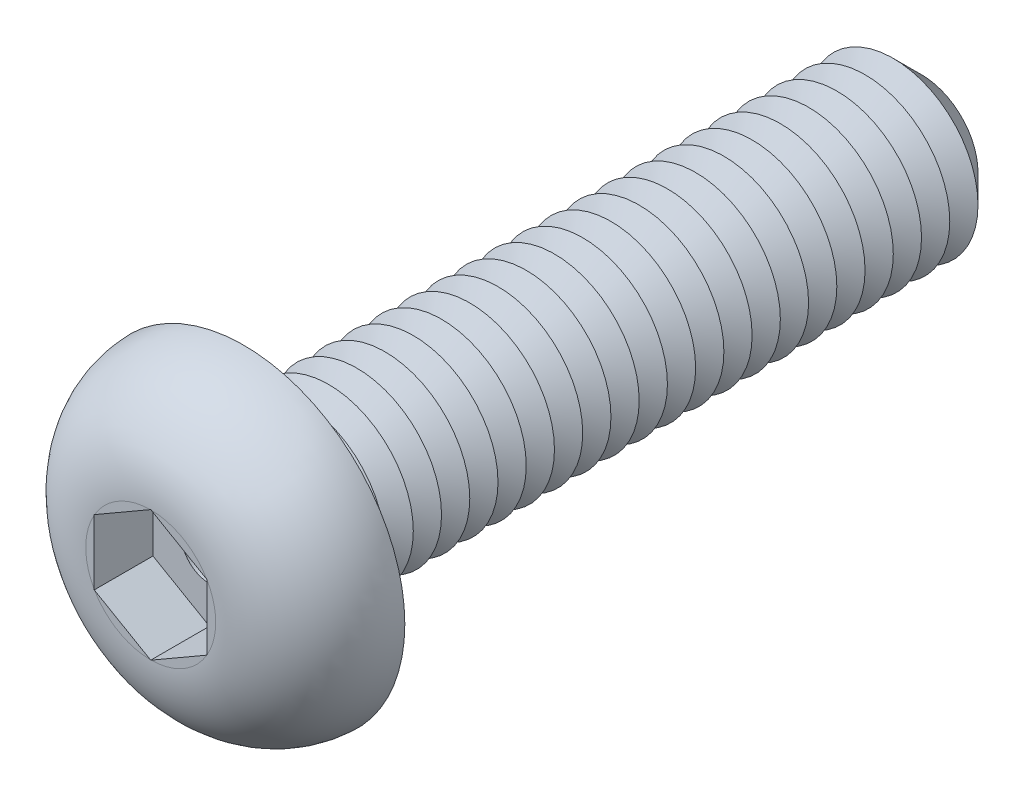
ISO-10303-21;
HEADER;
FILE_DESCRIPTION(('STEP AP214'),'2;1');
FILE_NAME('part.step','',(''),(''),'','','');
FILE_SCHEMA(('AUTOMOTIVE_DESIGN { 1 0 10303 214 1 1 1 1 }'));
ENDSEC;
DATA;
#1=APPLICATION_CONTEXT('core data for automotive mechanical design processes');
#2=APPLICATION_PROTOCOL_DEFINITION('international standard','automotive_design',2000,#1);
#3=PRODUCT_CONTEXT('',#1,'mechanical');
#4=PRODUCT('Part','Part','',(#3));
#5=PRODUCT_RELATED_PRODUCT_CATEGORY('part','',(#4));
#6=PRODUCT_DEFINITION_FORMATION('','',#4);
#7=PRODUCT_DEFINITION_CONTEXT('part definition',#1,'design');
#8=PRODUCT_DEFINITION('design','',#6,#7);
#9=PRODUCT_DEFINITION_SHAPE('','',#8);
#10=(LENGTH_UNIT() NAMED_UNIT(*) SI_UNIT(.MILLI.,.METRE.));
#11=(NAMED_UNIT(*) PLANE_ANGLE_UNIT() SI_UNIT($,.RADIAN.));
#12=(NAMED_UNIT(*) SI_UNIT($,.STERADIAN.) SOLID_ANGLE_UNIT());
#13=UNCERTAINTY_MEASURE_WITH_UNIT(LENGTH_MEASURE(1.E-05),#10,'distance_accuracy_value','');
#14=(GEOMETRIC_REPRESENTATION_CONTEXT(3) GLOBAL_UNCERTAINTY_ASSIGNED_CONTEXT((#13)) GLOBAL_UNIT_ASSIGNED_CONTEXT((#10,
#11,#12)) REPRESENTATION_CONTEXT('',''));
#15=CARTESIAN_POINT('',(0.,0.,0.));
#16=DIRECTION('',(0.,0.,1.));
#17=DIRECTION('',(1.,0.,0.));
#18=AXIS2_PLACEMENT_3D('',#15,#16,#17);
#19=CARTESIAN_POINT('',(0.,0.,-12.));
#20=DIRECTION('',(0.,0.,1.));
#21=DIRECTION('',(1.,0.,0.));
#22=AXIS2_PLACEMENT_3D('',#19,#20,#21);
#23=CYLINDRICAL_SURFACE('',#22,1.5);
#24=CARTESIAN_POINT('',(0.,0.,-0.25));
#25=DIRECTION('',(0.,0.,1.));
#26=DIRECTION('',(1.,0.,0.));
#27=AXIS2_PLACEMENT_3D('',#24,#25,#26);
#28=CIRCLE('',#27,1.5);
#29=CARTESIAN_POINT('',(1.5,0.,-0.25));
#30=VERTEX_POINT('',#29);
#31=EDGE_CURVE('E48',#30,#30,#28,.F.);
#32=ORIENTED_EDGE('',*,*,#31,.T.);
#33=EDGE_LOOP('',(#32));
#34=FACE_BOUND('',#33,.T.);
#35=CARTESIAN_POINT('',(0.,0.,-0.5));
#36=DIRECTION('',(0.,0.,1.));
#37=DIRECTION('',(1.,0.,0.));
#38=AXIS2_PLACEMENT_3D('',#35,#36,#37);
#39=CIRCLE('',#38,1.5);
#40=CARTESIAN_POINT('',(1.5,0.,-0.5));
#41=VERTEX_POINT('',#40);
#42=EDGE_CURVE('E160',#41,#41,#39,.T.);
#43=ORIENTED_EDGE('',*,*,#42,.T.);
#44=EDGE_LOOP('',(#43));
#45=FACE_BOUND('',#44,.T.);
#46=ADVANCED_FACE('F39',(#34,#45),#23,.T.);
#47=CARTESIAN_POINT('',(0.,0.,1.65));
#48=DIRECTION('',(0.,0.,-1.));
#49=DIRECTION('',(-1.,0.,0.));
#50=AXIS2_PLACEMENT_3D('',#47,#48,#49);
#51=PLANE('',#50);
#52=CARTESIAN_POINT('',(0.,0.,1.65));
#53=DIRECTION('',(0.,0.,1.));
#54=DIRECTION('',(1.,0.,0.));
#55=AXIS2_PLACEMENT_3D('',#52,#53,#54);
#56=CIRCLE('',#55,1.15073545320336);
#57=CARTESIAN_POINT('',(0.993096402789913,0.581336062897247,1.65));
#58=VERTEX_POINT('',#57);
#59=CARTESIAN_POINT('',(0.00690359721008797,1.15071474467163,1.65));
#60=VERTEX_POINT('',#59);
#61=EDGE_CURVE('E220',#58,#60,#56,.T.);
#62=ORIENTED_EDGE('',*,*,#61,.T.);
#63=DIRECTION('',(-0.866025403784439,0.5,0.));
#64=VECTOR('',#63,1.);
#65=CARTESIAN_POINT('',(1.,0.577350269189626,1.65));
#66=LINE('',#65,#64);
#67=EDGE_CURVE('E178',#58,#60,#66,.T.);
#68=ORIENTED_EDGE('',*,*,#67,.F.);
#69=EDGE_LOOP('',(#62,#68));
#70=FACE_BOUND('',#69,.T.);
#71=ADVANCED_FACE('F257',(#70),#51,.F.);
#72=CARTESIAN_POINT('',(1.,-0.569378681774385,1.65));
#73=VERTEX_POINT('',#72);
#74=CARTESIAN_POINT('',(1.,0.569378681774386,1.65));
#75=VERTEX_POINT('',#74);
#76=EDGE_CURVE('E215',#73,#75,#56,.T.);
#77=ORIENTED_EDGE('',*,*,#76,.T.);
#78=DIRECTION('',(0.,1.,0.));
#79=VECTOR('',#78,1.);
#80=CARTESIAN_POINT('',(1.,-0.577350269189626,1.65));
#81=LINE('',#80,#79);
#82=EDGE_CURVE('E63',#73,#75,#81,.T.);
#83=ORIENTED_EDGE('',*,*,#82,.F.);
#84=EDGE_LOOP('',(#77,#83));
#85=FACE_BOUND('',#84,.T.);
#86=ADVANCED_FACE('F263',(#85),#51,.F.);
#87=CARTESIAN_POINT('',(0.00690359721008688,-1.15071474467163,1.65));
#88=VERTEX_POINT('',#87);
#89=CARTESIAN_POINT('',(0.993096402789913,-0.581336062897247,1.65));
#90=VERTEX_POINT('',#89);
#91=EDGE_CURVE('E219',#88,#90,#56,.T.);
#92=ORIENTED_EDGE('',*,*,#91,.T.);
#93=DIRECTION('',(0.866025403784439,0.5,0.));
#94=VECTOR('',#93,1.);
#95=CARTESIAN_POINT('',(0.,-1.15470053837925,1.65));
#96=LINE('',#95,#94);
#97=EDGE_CURVE('E190',#88,#90,#96,.T.);
#98=ORIENTED_EDGE('',*,*,#97,.F.);
#99=EDGE_LOOP('',(#92,#98));
#100=FACE_BOUND('',#99,.T.);
#101=ADVANCED_FACE('F326',(#100),#51,.F.);
#102=CARTESIAN_POINT('',(-0.993096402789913,-0.581336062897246,1.65));
#103=VERTEX_POINT('',#102);
#104=CARTESIAN_POINT('',(-0.00690359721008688,-1.15071474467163,1.65));
#105=VERTEX_POINT('',#104);
#106=EDGE_CURVE('E336',#103,#105,#56,.T.);
#107=ORIENTED_EDGE('',*,*,#106,.T.);
#108=DIRECTION('',(0.866025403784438,-0.5,0.));
#109=VECTOR('',#108,1.);
#110=CARTESIAN_POINT('',(-1.,-0.577350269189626,1.65));
#111=LINE('',#110,#109);
#112=EDGE_CURVE('E186',#103,#105,#111,.T.);
#113=ORIENTED_EDGE('',*,*,#112,.F.);
#114=EDGE_LOOP('',(#107,#113));
#115=FACE_BOUND('',#114,.T.);
#116=ADVANCED_FACE('F321',(#115),#51,.F.);
#117=CARTESIAN_POINT('',(-1.,0.569378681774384,1.65));
#118=VERTEX_POINT('',#117);
#119=CARTESIAN_POINT('',(-1.,-0.569378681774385,1.65));
#120=VERTEX_POINT('',#119);
#121=EDGE_CURVE('E331',#118,#120,#56,.T.);
#122=ORIENTED_EDGE('',*,*,#121,.T.);
#123=DIRECTION('',(0.,-1.,0.));
#124=VECTOR('',#123,1.);
#125=CARTESIAN_POINT('',(-1.,0.577350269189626,1.65));
#126=LINE('',#125,#124);
#127=EDGE_CURVE('E182',#118,#120,#126,.T.);
#128=ORIENTED_EDGE('',*,*,#127,.F.);
#129=EDGE_LOOP('',(#122,#128));
#130=FACE_BOUND('',#129,.T.);
#131=ADVANCED_FACE('F312',(#130),#51,.F.);
#132=CARTESIAN_POINT('',(0.,2.85,0.));
#133=DIRECTION('',(0.,0.,1.));
#134=DIRECTION('',(1.,0.,0.));
#135=AXIS2_PLACEMENT_3D('',#132,#133,#134);
#136=PLANE('',#135);
#137=CARTESIAN_POINT('',(0.,0.,0.));
#138=DIRECTION('',(0.,0.,1.));
#139=DIRECTION('',(1.,0.,0.));
#140=AXIS2_PLACEMENT_3D('',#137,#138,#139);
#141=CIRCLE('',#140,1.75);
#142=CARTESIAN_POINT('',(1.75,0.,0.));
#143=VERTEX_POINT('',#142);
#144=EDGE_CURVE('E11',#143,#143,#141,.T.);
#145=ORIENTED_EDGE('',*,*,#144,.T.);
#146=EDGE_LOOP('',(#145));
#147=FACE_BOUND('',#146,.T.);
#148=CARTESIAN_POINT('',(0.,0.,0.));
#149=DIRECTION('',(0.,0.,1.));
#150=DIRECTION('',(1.,0.,0.));
#151=AXIS2_PLACEMENT_3D('',#148,#149,#150);
#152=CIRCLE('',#151,2.85);
#153=CARTESIAN_POINT('',(2.85,0.,0.));
#154=VERTEX_POINT('',#153);
#155=EDGE_CURVE('E197',#154,#154,#152,.T.);
#156=ORIENTED_EDGE('',*,*,#155,.F.);
#157=EDGE_LOOP('',(#156));
#158=FACE_BOUND('',#157,.T.);
#159=ADVANCED_FACE('F309',(#147,#158),#136,.F.);
#160=CARTESIAN_POINT('',(-0.00690359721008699,1.15071474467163,1.65));
#161=VERTEX_POINT('',#160);
#162=CARTESIAN_POINT('',(-0.993096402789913,0.581336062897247,1.65));
#163=VERTEX_POINT('',#162);
#164=EDGE_CURVE('E335',#161,#163,#56,.T.);
#165=ORIENTED_EDGE('',*,*,#164,.T.);
#166=DIRECTION('',(-0.866025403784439,-0.5,0.));
#167=VECTOR('',#166,1.);
#168=CARTESIAN_POINT('',(0.,1.15470053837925,1.65));
#169=LINE('',#168,#167);
#170=EDGE_CURVE('E177',#161,#163,#169,.T.);
#171=ORIENTED_EDGE('',*,*,#170,.F.);
#172=EDGE_LOOP('',(#165,#171));
#173=FACE_BOUND('',#172,.T.);
#174=ADVANCED_FACE('F254',(#173),#51,.F.);
#175=CARTESIAN_POINT('',(0.,0.,-0.0499999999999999));
#176=DIRECTION('',(0.,0.,1.));
#177=DIRECTION('',(1.,0.,0.));
#178=AXIS2_PLACEMENT_3D('',#175,#176,#177);
#179=DEGENERATE_TOROIDAL_SURFACE('',#178,1.15073545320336,1.7,.T.);
#180=ORIENTED_EDGE('',*,*,#61,.F.);
#181=CARTESIAN_POINT('',(1.,0.577350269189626,1.65));
#182=VERTEX_POINT('',#181);
#183=EDGE_CURVE('E174',#182,#58,#66,.T.);
#184=ORIENTED_EDGE('',*,*,#183,.F.);
#185=CARTESIAN_POINT('',(1.,0.,1.64330411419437));
#186=CARTESIAN_POINT('',(1.,-0.0418495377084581,1.64330316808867));
#187=CARTESIAN_POINT('',(1.,-0.0836989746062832,1.64354559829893));
#188=CARTESIAN_POINT('',(1.,-0.167393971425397,1.64442358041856));
#189=CARTESIAN_POINT('',(1.,-0.209239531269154,1.64505913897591));
#190=CARTESIAN_POINT('',(1.,-0.334845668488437,1.64722576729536));
#191=CARTESIAN_POINT('',(1.,-0.418601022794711,1.64901611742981));
#192=CARTESIAN_POINT('',(1.,-0.585792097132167,1.65039211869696));
#193=CARTESIAN_POINT('',(1.,-0.669227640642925,1.64998722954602));
#194=CARTESIAN_POINT('',(1.,-0.83590094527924,1.6440300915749));
#195=CARTESIAN_POINT('',(1.,-0.919138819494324,1.63848280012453));
#196=CARTESIAN_POINT('',(1.,-1.0594136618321,1.62282805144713));
#197=CARTESIAN_POINT('',(1.,-1.11666006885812,1.61463991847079));
#198=CARTESIAN_POINT('',(1.,-1.23041128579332,1.59417176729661));
#199=CARTESIAN_POINT('',(1.,-1.2869163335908,1.58189309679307));
#200=CARTESIAN_POINT('',(1.,-1.39883762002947,1.55283610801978));
#201=CARTESIAN_POINT('',(1.,-1.45425254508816,1.53605268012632));
#202=CARTESIAN_POINT('',(1.,-1.56342884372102,1.49775525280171));
#203=CARTESIAN_POINT('',(1.,-1.61719032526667,1.47624156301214));
#204=CARTESIAN_POINT('',(1.,-1.72305248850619,1.42814032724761));
#205=CARTESIAN_POINT('',(1.,-1.77513121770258,1.40150424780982));
#206=CARTESIAN_POINT('',(1.,-1.87650034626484,1.34331391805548));
#207=CARTESIAN_POINT('',(1.,-1.92578956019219,1.31175759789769));
#208=CARTESIAN_POINT('',(1.,-2.02094663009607,1.24389579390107));
#209=CARTESIAN_POINT('',(1.,-2.06681670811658,1.20759343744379));
#210=CARTESIAN_POINT('',(1.,-2.15460705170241,1.13048515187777));
#211=CARTESIAN_POINT('',(1.,-2.19652613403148,1.08967788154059));
#212=CARTESIAN_POINT('',(1.,-2.30373588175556,0.973753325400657));
#213=CARTESIAN_POINT('',(1.,-2.36480639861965,0.894640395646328));
#214=CARTESIAN_POINT('',(1.,-2.47150299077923,0.726696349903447));
#215=CARTESIAN_POINT('',(1.,-2.51713890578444,0.637871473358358));
#216=CARTESIAN_POINT('',(1.,-2.58857066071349,0.46005750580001));
#217=CARTESIAN_POINT('',(1.,-2.61556805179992,0.371550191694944));
#218=CARTESIAN_POINT('',(1.,-2.65390085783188,0.191213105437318));
#219=CARTESIAN_POINT('',(1.,-2.66523955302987,0.0993840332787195));
#220=CARTESIAN_POINT('',(1.,-2.67179092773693,-0.0825708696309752));
#221=CARTESIAN_POINT('',(1.,-2.66739421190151,-0.17268289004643));
#222=CARTESIAN_POINT('',(1.,-2.64348567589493,-0.350883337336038));
#223=CARTESIAN_POINT('',(1.,-2.62397312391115,-0.438971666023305));
#224=CARTESIAN_POINT('',(1.,-2.57054048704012,-0.610404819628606));
#225=CARTESIAN_POINT('',(1.,-2.53665793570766,-0.693761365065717));
#226=CARTESIAN_POINT('',(1.,-2.45559893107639,-0.85368978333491));
#227=CARTESIAN_POINT('',(1.,-2.40842683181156,-0.930263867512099));
#228=CARTESIAN_POINT('',(1.,-2.30144802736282,-1.07583692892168));
#229=CARTESIAN_POINT('',(1.,-2.24145688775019,-1.14470015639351));
#230=CARTESIAN_POINT('',(1.,-2.11112251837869,-1.27193159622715));
#231=CARTESIAN_POINT('',(1.,-2.04076746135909,-1.33028764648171));
#232=CARTESIAN_POINT('',(1.,-1.88862864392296,-1.43765509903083));
#233=CARTESIAN_POINT('',(1.,-1.80648025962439,-1.48614793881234));
#234=CARTESIAN_POINT('',(1.,-1.63600727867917,-1.56989445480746));
#235=CARTESIAN_POINT('',(1.,-1.54769931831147,-1.60518226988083));
#236=CARTESIAN_POINT('',(1.,-1.39091080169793,-1.65552596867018));
#237=CARTESIAN_POINT('',(1.,-1.32332513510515,-1.67346211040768));
#238=CARTESIAN_POINT('',(1.,-1.18678249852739,-1.70305339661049));
#239=CARTESIAN_POINT('',(1.,-1.11782507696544,-1.71470643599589));
#240=CARTESIAN_POINT('',(1.,-0.978842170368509,-1.73262758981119));
#241=CARTESIAN_POINT('',(1.,-0.908812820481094,-1.73886428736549));
#242=CARTESIAN_POINT('',(1.,-0.768519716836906,-1.74708473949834));
#243=CARTESIAN_POINT('',(1.,-0.698255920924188,-1.74906768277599));
#244=CARTESIAN_POINT('',(1.,-0.527772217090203,-1.75068316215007));
#245=CARTESIAN_POINT('',(1.,-0.427552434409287,-1.74895318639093));
#246=CARTESIAN_POINT('',(1.,-0.27725595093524,-1.74623781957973));
#247=CARTESIAN_POINT('',(1.,-0.227169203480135,-1.74531275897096));
#248=CARTESIAN_POINT('',(1.,-0.126990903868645,-1.74392135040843));
#249=CARTESIAN_POINT('',(1.,-0.0768993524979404,-1.74345496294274));
#250=CARTESIAN_POINT('',(1.,0.02329543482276,-1.7432171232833));
#251=CARTESIAN_POINT('',(1.,0.073398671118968,-1.74344580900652));
#252=CARTESIAN_POINT('',(1.,0.173601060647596,-1.74448066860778));
#253=CARTESIAN_POINT('',(1.,0.223700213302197,-1.74528688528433));
#254=CARTESIAN_POINT('',(1.,0.374032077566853,-1.74796102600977));
#255=CARTESIAN_POINT('',(1.,0.474263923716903,-1.7500840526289));
#256=CARTESIAN_POINT('',(1.,0.646038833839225,-1.74993675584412));
#257=CARTESIAN_POINT('',(1.,0.717572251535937,-1.74875105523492));
#258=CARTESIAN_POINT('',(1.,0.860467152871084,-1.74232930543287));
#259=CARTESIAN_POINT('',(0.999999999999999,0.931828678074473,-1.73709436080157));
#260=CARTESIAN_POINT('',(0.999999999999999,1.07356885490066,-1.72122033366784));
#261=CARTESIAN_POINT('',(0.999999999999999,1.14395079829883,-1.71061248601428));
#262=CARTESIAN_POINT('',(0.999999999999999,1.28345101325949,-1.6830362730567));
#263=CARTESIAN_POINT('',(0.999999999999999,1.35256960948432,-1.66606956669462));
#264=CARTESIAN_POINT('',(0.999999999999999,1.51915230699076,-1.61597650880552));
#265=CARTESIAN_POINT('',(0.999999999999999,1.61551282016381,-1.5790180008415));
#266=CARTESIAN_POINT('',(0.999999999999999,1.80117858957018,-1.48957694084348));
#267=CARTESIAN_POINT('',(0.999999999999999,1.89046083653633,-1.43704619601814));
#268=CARTESIAN_POINT('',(0.999999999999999,2.05877104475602,-1.31682583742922));
#269=CARTESIAN_POINT('',(0.999999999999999,2.13775712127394,-1.24907718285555));
#270=CARTESIAN_POINT('',(0.999999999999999,2.28184060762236,-1.10027015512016));
#271=CARTESIAN_POINT('',(0.999999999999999,2.34695771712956,-1.01923095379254));
#272=CARTESIAN_POINT('',(0.999999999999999,2.45608578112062,-0.853423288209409));
#273=CARTESIAN_POINT('',(0.999999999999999,2.5013878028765,-0.769502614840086));
#274=CARTESIAN_POINT('',(0.999999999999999,2.5765359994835,-0.594973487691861));
#275=CARTESIAN_POINT('',(0.999999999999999,2.60638146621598,-0.504364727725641));
#276=CARTESIAN_POINT('',(0.999999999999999,2.64857466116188,-0.323348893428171));
#277=CARTESIAN_POINT('',(0.999999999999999,2.66163020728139,-0.2331061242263));
#278=CARTESIAN_POINT('',(0.999999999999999,2.67217366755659,-0.0517287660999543));
#279=CARTESIAN_POINT('',(0.999999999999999,2.66966509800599,0.0394056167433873));
#280=CARTESIAN_POINT('',(0.999999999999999,2.64931179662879,0.218675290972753));
#281=CARTESIAN_POINT('',(0.999999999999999,2.63167707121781,0.306834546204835));
#282=CARTESIAN_POINT('',(0.999999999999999,2.58192713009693,0.478965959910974));
#283=CARTESIAN_POINT('',(0.999999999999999,2.54981137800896,0.562937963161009));
#284=CARTESIAN_POINT('',(0.999999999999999,2.47193161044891,0.724823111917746));
#285=CARTESIAN_POINT('',(0.999999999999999,2.42609746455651,0.802702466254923));
#286=CARTESIAN_POINT('',(0.999999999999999,2.32231485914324,0.949889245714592));
#287=CARTESIAN_POINT('',(0.999999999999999,2.26436747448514,1.01919743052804));
#288=CARTESIAN_POINT('',(0.999999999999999,2.13654618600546,1.14929270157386));
#289=CARTESIAN_POINT('',(0.999999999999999,2.0664051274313,1.20981647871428));
#290=CARTESIAN_POINT('',(0.999999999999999,1.9173872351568,1.31904487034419));
#291=CARTESIAN_POINT('',(0.999999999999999,1.83850453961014,1.36774148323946));
#292=CARTESIAN_POINT('',(0.999999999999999,1.71289874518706,1.4328215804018));
#293=CARTESIAN_POINT('',(0.999999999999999,1.66841297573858,1.45365843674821));
#294=CARTESIAN_POINT('',(0.999999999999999,1.57796501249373,1.49187589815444));
#295=CARTESIAN_POINT('',(0.999999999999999,1.53200259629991,1.50925597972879));
#296=CARTESIAN_POINT('',(0.999999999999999,1.43903939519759,1.54059227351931));
#297=CARTESIAN_POINT('',(0.999999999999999,1.39204097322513,1.55455554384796));
#298=CARTESIAN_POINT('',(0.999999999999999,1.29722920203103,1.57925913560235));
#299=CARTESIAN_POINT('',(0.999999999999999,1.24941611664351,1.59000048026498));
#300=CARTESIAN_POINT('',(0.999999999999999,1.10320842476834,1.61808076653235));
#301=CARTESIAN_POINT('',(0.999999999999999,1.00389041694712,1.63067408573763));
#302=CARTESIAN_POINT('',(0.999999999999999,0.804462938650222,1.6463207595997));
#303=CARTESIAN_POINT('',(1.,0.704352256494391,1.64935433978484));
#304=CARTESIAN_POINT('',(1.,0.503474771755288,1.65046619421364));
#305=CARTESIAN_POINT('',(0.999999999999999,0.402708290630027,1.64850957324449));
#306=CARTESIAN_POINT('',(1.,0.251622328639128,1.64577086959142));
#307=CARTESIAN_POINT('',(1.,0.201301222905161,1.64489114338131));
#308=CARTESIAN_POINT('',(1.,0.100653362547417,1.64365834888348));
#309=CARTESIAN_POINT('',(1.,0.0503266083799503,1.64330525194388));
#310=CARTESIAN_POINT('',(1.,0.,1.64330411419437));
#311=B_SPLINE_CURVE_WITH_KNOTS('',3,(#185,#186,#187,#188,#189,#190,#191,#192,#193,#194,#195,
#196,#197,#198,#199,#200,#201,#202,#203,#204,#205,#206,#207,#208,#209,#210,#211,#212,#213,#214,
#215,#216,#217,#218,#219,#220,#221,#222,#223,#224,#225,#226,#227,#228,#229,#230,#231,#232,#233,
#234,#235,#236,#237,#238,#239,#240,#241,#242,#243,#244,#245,#246,#247,#248,#249,#250,#251,#252,
#253,#254,#255,#256,#257,#258,#259,#260,#261,#262,#263,#264,#265,#266,#267,#268,#269,#270,#271,
#272,#273,#274,#275,#276,#277,#278,#279,#280,#281,#282,#283,#284,#285,#286,#287,#288,#289,#290,
#291,#292,#293,#294,#295,#296,#297,#298,#299,#300,#301,#302,#303,#304,#305,#306,#307,#308,#309,
#310),.UNSPECIFIED.,.T.,.F.,(4,2,2,2,2,2,2,2,2,2,2,2,2,2,2,2,2,2,2,2,2,2,2,2,2,2,2,2,2,2,2,2,2,
2,2,2,2,2,2,2,2,2,2,2,2,2,2,2,2,2,2,2,2,2,2,2,2,2,2,2,2,2,4),(0.,0.125547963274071,
0.251098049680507,0.502422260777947,0.752664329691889,1.00266541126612,1.17602519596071,
1.34932792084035,1.52282805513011,1.69631683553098,1.87153849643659,2.04683406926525,
2.22201470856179,2.39724764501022,2.69534138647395,2.99324473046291,3.26948200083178,
3.54566139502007,3.81503317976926,4.08441800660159,4.35310350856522,4.62170108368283,
4.89446026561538,5.16753316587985,5.45251589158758,5.73675667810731,5.94622800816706,
6.15576947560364,6.3665183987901,6.57730751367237,6.87796487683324,7.02825425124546,
7.17853067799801,7.32883692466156,7.47915431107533,7.77989491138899,7.99445526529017,
8.20895711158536,8.42222604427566,8.63543937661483,8.94372593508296,9.25297671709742,
9.56344868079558,9.87347666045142,10.1581355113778,10.4428074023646,10.715036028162,
10.9872031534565,11.2556516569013,11.5241101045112,11.7939650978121,12.0637961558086,
12.3405292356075,12.6174490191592,12.7646985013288,12.9119702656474,13.0589351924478,
13.2058533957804,13.5054664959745,13.8056989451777,14.1080365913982,14.2590238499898,
14.410002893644),.UNSPECIFIED.);
#312=EDGE_CURVE('E278',#182,#75,#311,.T.);
#313=ORIENTED_EDGE('',*,*,#312,.T.);
#314=ORIENTED_EDGE('',*,*,#76,.F.);
#315=CARTESIAN_POINT('',(1.,-0.577350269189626,1.65));
#316=VERTEX_POINT('',#315);
#317=EDGE_CURVE('E154',#316,#73,#81,.T.);
#318=ORIENTED_EDGE('',*,*,#317,.F.);
#319=CARTESIAN_POINT('',(1.0002,-0.577234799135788,1.64999510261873));
#320=CARTESIAN_POINT('',(0.958507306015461,-0.601306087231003,1.65004608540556));
#321=CARTESIAN_POINT('',(0.916820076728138,-0.625374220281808,1.64959104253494));
#322=CARTESIAN_POINT('',(0.83344664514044,-0.673509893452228,1.64822305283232));
#323=CARTESIAN_POINT('',(0.791760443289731,-0.697577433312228,1.6473100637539));
#324=CARTESIAN_POINT('',(0.708395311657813,-0.745708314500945,1.64558069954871));
#325=CARTESIAN_POINT('',(0.666716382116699,-0.769771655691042,1.64476430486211));
#326=CARTESIAN_POINT('',(0.58335598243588,-0.817899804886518,1.64362601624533));
#327=CARTESIAN_POINT('',(0.541674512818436,-0.841964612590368,1.64330408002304));
#328=CARTESIAN_POINT('',(0.45831273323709,-0.890093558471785,1.64330414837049));
#329=CARTESIAN_POINT('',(0.416632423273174,-0.914157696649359,1.64362613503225));
#330=CARTESIAN_POINT('',(0.333274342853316,-0.962284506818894,1.64476447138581));
#331=CARTESIAN_POINT('',(0.291596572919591,-0.986347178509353,1.64558086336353));
#332=CARTESIAN_POINT('',(0.208233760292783,-1.03447672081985,1.64731018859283));
#333=CARTESIAN_POINT('',(0.166548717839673,-1.05854359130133,1.64822314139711));
#334=CARTESIAN_POINT('',(0.0831776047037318,-1.106677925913,1.64959106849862));
#335=CARTESIAN_POINT('',(0.0414915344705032,-1.13074538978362,1.65004608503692));
#336=CARTESIAN_POINT('',(-0.00020000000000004,-1.15481600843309,1.64999510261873));
#337=B_SPLINE_CURVE_WITH_KNOTS('',3,(#319,#320,#321,#322,#323,#324,#325,#326,#327,#328,#329,
#330,#331,#332,#333,#334,#335,#336),.UNSPECIFIED.,.F.,.F.,(4,2,2,2,2,2,2,2,4),(0.,
0.144416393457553,0.288846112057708,0.433246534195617,0.577634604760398,0.722018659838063,
0.866415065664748,1.01084076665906,1.15525314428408),.UNSPECIFIED.);
#338=EDGE_CURVE('E285',#316,#90,#337,.T.);
#339=ORIENTED_EDGE('',*,*,#338,.T.);
#340=ORIENTED_EDGE('',*,*,#91,.F.);
#341=CARTESIAN_POINT('',(0.,-1.15470053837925,1.65));
#342=VERTEX_POINT('',#341);
#343=EDGE_CURVE('E191',#342,#88,#96,.T.);
#344=ORIENTED_EDGE('',*,*,#343,.F.);
#345=CARTESIAN_POINT('',(0.000199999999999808,-1.15481600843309,1.64999510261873));
#346=CARTESIAN_POINT('',(-0.0414926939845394,-1.13074472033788,1.65004608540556));
#347=CARTESIAN_POINT('',(-0.0831799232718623,-1.10667658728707,1.64959104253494));
#348=CARTESIAN_POINT('',(-0.166553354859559,-1.05854091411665,1.64822305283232));
#349=CARTESIAN_POINT('',(-0.208239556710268,-1.03447337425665,1.6473100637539));
#350=CARTESIAN_POINT('',(-0.291604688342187,-0.986342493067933,1.64558069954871));
#351=CARTESIAN_POINT('',(-0.333283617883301,-0.962279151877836,1.64476430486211));
#352=CARTESIAN_POINT('',(-0.41664401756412,-0.91415100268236,1.64362601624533));
#353=CARTESIAN_POINT('',(-0.458325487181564,-0.89008619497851,1.64330408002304));
#354=CARTESIAN_POINT('',(-0.54168726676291,-0.841957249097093,1.64330414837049));
#355=CARTESIAN_POINT('',(-0.583367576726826,-0.817893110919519,1.64362613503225));
#356=CARTESIAN_POINT('',(-0.666725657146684,-0.769766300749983,1.64476447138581));
#357=CARTESIAN_POINT('',(-0.708403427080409,-0.745703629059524,1.64558086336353));
#358=CARTESIAN_POINT('',(-0.791766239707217,-0.697574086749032,1.64731018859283));
#359=CARTESIAN_POINT('',(-0.833451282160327,-0.673507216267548,1.64822314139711));
#360=CARTESIAN_POINT('',(-0.916822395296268,-0.625372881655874,1.64959106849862));
#361=CARTESIAN_POINT('',(-0.958508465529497,-0.601305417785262,1.65004608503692));
#362=CARTESIAN_POINT('',(-1.0002,-0.577234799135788,1.64999510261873));
#363=B_SPLINE_CURVE_WITH_KNOTS('',3,(#345,#346,#347,#348,#349,#350,#351,#352,#353,#354,#355,
#356,#357,#358,#359,#360,#361,#362),.UNSPECIFIED.,.F.,.F.,(4,2,2,2,2,2,2,2,4),(0.,
0.144416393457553,0.288846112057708,0.433246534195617,0.577634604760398,0.722018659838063,
0.866415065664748,1.01084076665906,1.15525314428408),.UNSPECIFIED.);
#364=EDGE_CURVE('E360',#342,#105,#363,.T.);
#365=ORIENTED_EDGE('',*,*,#364,.T.);
#366=ORIENTED_EDGE('',*,*,#106,.F.);
#367=CARTESIAN_POINT('',(-1.,-0.577350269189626,1.65));
#368=VERTEX_POINT('',#367);
#369=EDGE_CURVE('E187',#368,#103,#111,.T.);
#370=ORIENTED_EDGE('',*,*,#369,.F.);
#371=CARTESIAN_POINT('',(-1.,0.,1.64330411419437));
#372=CARTESIAN_POINT('',(-1.,0.0418495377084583,1.64330316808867));
#373=CARTESIAN_POINT('',(-1.,0.0836989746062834,1.64354559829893));
#374=CARTESIAN_POINT('',(-1.,0.167393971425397,1.64442358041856));
#375=CARTESIAN_POINT('',(-1.,0.209239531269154,1.64505913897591));
#376=CARTESIAN_POINT('',(-1.,0.334845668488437,1.64722576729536));
#377=CARTESIAN_POINT('',(-1.,0.418601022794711,1.64901611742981));
#378=CARTESIAN_POINT('',(-1.,0.585792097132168,1.65039211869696));
#379=CARTESIAN_POINT('',(-1.,0.669227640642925,1.64998722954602));
#380=CARTESIAN_POINT('',(-1.,0.835900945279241,1.6440300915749));
#381=CARTESIAN_POINT('',(-1.,0.919138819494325,1.63848280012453));
#382=CARTESIAN_POINT('',(-1.,1.0594136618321,1.62282805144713));
#383=CARTESIAN_POINT('',(-1.,1.11666006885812,1.61463991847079));
#384=CARTESIAN_POINT('',(-1.,1.23041128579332,1.59417176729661));
#385=CARTESIAN_POINT('',(-1.,1.2869163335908,1.58189309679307));
#386=CARTESIAN_POINT('',(-1.,1.39883762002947,1.55283610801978));
#387=CARTESIAN_POINT('',(-1.,1.45425254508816,1.53605268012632));
#388=CARTESIAN_POINT('',(-1.,1.56342884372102,1.49775525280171));
#389=CARTESIAN_POINT('',(-1.,1.61719032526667,1.47624156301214));
#390=CARTESIAN_POINT('',(-1.,1.72305248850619,1.42814032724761));
#391=CARTESIAN_POINT('',(-1.,1.77513121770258,1.40150424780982));
#392=CARTESIAN_POINT('',(-1.,1.87650034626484,1.34331391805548));
#393=CARTESIAN_POINT('',(-1.,1.92578956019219,1.31175759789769));
#394=CARTESIAN_POINT('',(-1.,2.02094663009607,1.24389579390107));
#395=CARTESIAN_POINT('',(-1.,2.06681670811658,1.20759343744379));
#396=CARTESIAN_POINT('',(-1.,2.15460705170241,1.13048515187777));
#397=CARTESIAN_POINT('',(-1.,2.19652613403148,1.08967788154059));
#398=CARTESIAN_POINT('',(-1.,2.30373588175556,0.973753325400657));
#399=CARTESIAN_POINT('',(-1.,2.36480639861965,0.894640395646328));
#400=CARTESIAN_POINT('',(-1.,2.47150299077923,0.726696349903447));
#401=CARTESIAN_POINT('',(-1.,2.51713890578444,0.637871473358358));
#402=CARTESIAN_POINT('',(-1.,2.58857066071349,0.46005750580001));
#403=CARTESIAN_POINT('',(-1.,2.61556805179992,0.371550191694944));
#404=CARTESIAN_POINT('',(-1.,2.65390085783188,0.191213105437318));
#405=CARTESIAN_POINT('',(-1.,2.66523955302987,0.0993840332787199));
#406=CARTESIAN_POINT('',(-1.,2.67179092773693,-0.0825708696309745));
#407=CARTESIAN_POINT('',(-1.,2.66739421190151,-0.17268289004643));
#408=CARTESIAN_POINT('',(-1.,2.64348567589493,-0.350883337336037));
#409=CARTESIAN_POINT('',(-1.,2.62397312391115,-0.438971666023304));
#410=CARTESIAN_POINT('',(-1.,2.57054048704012,-0.610404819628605));
#411=CARTESIAN_POINT('',(-1.,2.53665793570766,-0.693761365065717));
#412=CARTESIAN_POINT('',(-1.,2.45559893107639,-0.853689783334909));
#413=CARTESIAN_POINT('',(-1.,2.40842683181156,-0.930263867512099));
#414=CARTESIAN_POINT('',(-1.,2.30144802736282,-1.07583692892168));
#415=CARTESIAN_POINT('',(-1.,2.24145688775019,-1.14470015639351));
#416=CARTESIAN_POINT('',(-1.,2.11112251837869,-1.27193159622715));
#417=CARTESIAN_POINT('',(-1.,2.04076746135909,-1.33028764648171));
#418=CARTESIAN_POINT('',(-1.,1.88862864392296,-1.43765509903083));
#419=CARTESIAN_POINT('',(-1.,1.80648025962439,-1.48614793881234));
#420=CARTESIAN_POINT('',(-1.,1.63600727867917,-1.56989445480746));
#421=CARTESIAN_POINT('',(-1.,1.54769931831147,-1.60518226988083));
#422=CARTESIAN_POINT('',(-1.,1.39091080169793,-1.65552596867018));
#423=CARTESIAN_POINT('',(-1.,1.32332513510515,-1.67346211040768));
#424=CARTESIAN_POINT('',(-1.,1.18678249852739,-1.70305339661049));
#425=CARTESIAN_POINT('',(-1.,1.11782507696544,-1.71470643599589));
#426=CARTESIAN_POINT('',(-1.,0.97884217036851,-1.73262758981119));
#427=CARTESIAN_POINT('',(-1.,0.908812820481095,-1.73886428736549));
#428=CARTESIAN_POINT('',(-1.,0.768519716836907,-1.74708473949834));
#429=CARTESIAN_POINT('',(-1.,0.698255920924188,-1.74906768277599));
#430=CARTESIAN_POINT('',(-1.,0.527772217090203,-1.75068316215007));
#431=CARTESIAN_POINT('',(-1.,0.427552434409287,-1.74895318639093));
#432=CARTESIAN_POINT('',(-1.,0.27725595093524,-1.74623781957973));
#433=CARTESIAN_POINT('',(-1.,0.227169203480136,-1.74531275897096));
#434=CARTESIAN_POINT('',(-1.,0.126990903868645,-1.74392135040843));
#435=CARTESIAN_POINT('',(-1.,0.0768993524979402,-1.74345496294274));
#436=CARTESIAN_POINT('',(-1.,-0.0232954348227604,-1.7432171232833));
#437=CARTESIAN_POINT('',(-1.,-0.0733986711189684,-1.74344580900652));
#438=CARTESIAN_POINT('',(-1.,-0.173601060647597,-1.74448066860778));
#439=CARTESIAN_POINT('',(-1.,-0.223700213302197,-1.74528688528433));
#440=CARTESIAN_POINT('',(-1.,-0.374032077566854,-1.74796102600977));
#441=CARTESIAN_POINT('',(-1.,-0.474263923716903,-1.7500840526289));
#442=CARTESIAN_POINT('',(-1.,-0.646038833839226,-1.74993675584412));
#443=CARTESIAN_POINT('',(-1.,-0.717572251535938,-1.74875105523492));
#444=CARTESIAN_POINT('',(-1.,-0.860467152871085,-1.74232930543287));
#445=CARTESIAN_POINT('',(-1.,-0.931828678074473,-1.73709436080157));
#446=CARTESIAN_POINT('',(-1.,-1.07356885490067,-1.72122033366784));
#447=CARTESIAN_POINT('',(-1.,-1.14395079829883,-1.71061248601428));
#448=CARTESIAN_POINT('',(-1.,-1.28345101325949,-1.6830362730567));
#449=CARTESIAN_POINT('',(-1.,-1.35256960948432,-1.66606956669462));
#450=CARTESIAN_POINT('',(-1.,-1.51915230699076,-1.61597650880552));
#451=CARTESIAN_POINT('',(-1.,-1.61551282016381,-1.5790180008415));
#452=CARTESIAN_POINT('',(-1.,-1.80117858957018,-1.48957694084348));
#453=CARTESIAN_POINT('',(-1.,-1.89046083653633,-1.43704619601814));
#454=CARTESIAN_POINT('',(-1.,-2.05877104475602,-1.31682583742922));
#455=CARTESIAN_POINT('',(-0.999999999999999,-2.13775712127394,-1.24907718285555));
#456=CARTESIAN_POINT('',(-0.999999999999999,-2.28184060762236,-1.10027015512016));
#457=CARTESIAN_POINT('',(-0.999999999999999,-2.34695771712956,-1.01923095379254));
#458=CARTESIAN_POINT('',(-0.999999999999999,-2.45608578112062,-0.85342328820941));
#459=CARTESIAN_POINT('',(-0.999999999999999,-2.50138780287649,-0.769502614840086));
#460=CARTESIAN_POINT('',(-0.999999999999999,-2.5765359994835,-0.594973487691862));
#461=CARTESIAN_POINT('',(-0.999999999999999,-2.60638146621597,-0.504364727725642));
#462=CARTESIAN_POINT('',(-0.999999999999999,-2.64857466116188,-0.323348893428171));
#463=CARTESIAN_POINT('',(-0.999999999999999,-2.66163020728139,-0.2331061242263));
#464=CARTESIAN_POINT('',(-0.999999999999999,-2.67217366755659,-0.0517287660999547));
#465=CARTESIAN_POINT('',(-0.999999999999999,-2.66966509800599,0.0394056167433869));
#466=CARTESIAN_POINT('',(-0.999999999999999,-2.64931179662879,0.218675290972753));
#467=CARTESIAN_POINT('',(-0.999999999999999,-2.63167707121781,0.306834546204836));
#468=CARTESIAN_POINT('',(-0.999999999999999,-2.58192713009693,0.478965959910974));
#469=CARTESIAN_POINT('',(-0.999999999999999,-2.54981137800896,0.562937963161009));
#470=CARTESIAN_POINT('',(-0.999999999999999,-2.47193161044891,0.724823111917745));
#471=CARTESIAN_POINT('',(-0.999999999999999,-2.42609746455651,0.802702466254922));
#472=CARTESIAN_POINT('',(-0.999999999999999,-2.32231485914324,0.949889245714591));
#473=CARTESIAN_POINT('',(-0.999999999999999,-2.26436747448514,1.01919743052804));
#474=CARTESIAN_POINT('',(-0.999999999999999,-2.13654618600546,1.14929270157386));
#475=CARTESIAN_POINT('',(-1.,-2.06640512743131,1.20981647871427));
#476=CARTESIAN_POINT('',(-1.,-1.9173872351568,1.31904487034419));
#477=CARTESIAN_POINT('',(-1.,-1.83850453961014,1.36774148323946));
#478=CARTESIAN_POINT('',(-1.,-1.71289874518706,1.4328215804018));
#479=CARTESIAN_POINT('',(-1.,-1.66841297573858,1.45365843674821));
#480=CARTESIAN_POINT('',(-1.,-1.57796501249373,1.49187589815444));
#481=CARTESIAN_POINT('',(-1.,-1.53200259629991,1.50925597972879));
#482=CARTESIAN_POINT('',(-1.,-1.43903939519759,1.54059227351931));
#483=CARTESIAN_POINT('',(-1.,-1.39204097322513,1.55455554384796));
#484=CARTESIAN_POINT('',(-1.,-1.29722920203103,1.57925913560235));
#485=CARTESIAN_POINT('',(-1.,-1.24941611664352,1.59000048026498));
#486=CARTESIAN_POINT('',(-1.,-1.10320842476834,1.61808076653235));
#487=CARTESIAN_POINT('',(-1.,-1.00389041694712,1.63067408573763));
#488=CARTESIAN_POINT('',(-1.,-0.804462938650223,1.6463207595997));
#489=CARTESIAN_POINT('',(-1.,-0.704352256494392,1.64935433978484));
#490=CARTESIAN_POINT('',(-1.,-0.503474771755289,1.65046619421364));
#491=CARTESIAN_POINT('',(-1.,-0.402708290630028,1.64850957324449));
#492=CARTESIAN_POINT('',(-1.,-0.251622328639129,1.64577086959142));
#493=CARTESIAN_POINT('',(-1.,-0.201301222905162,1.64489114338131));
#494=CARTESIAN_POINT('',(-1.,-0.100653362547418,1.64365834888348));
#495=CARTESIAN_POINT('',(-1.,-0.0503266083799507,1.64330525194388));
#496=CARTESIAN_POINT('',(-1.,0.,1.64330411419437));
#497=B_SPLINE_CURVE_WITH_KNOTS('',3,(#371,#372,#373,#374,#375,#376,#377,#378,#379,#380,#381,
#382,#383,#384,#385,#386,#387,#388,#389,#390,#391,#392,#393,#394,#395,#396,#397,#398,#399,#400,
#401,#402,#403,#404,#405,#406,#407,#408,#409,#410,#411,#412,#413,#414,#415,#416,#417,#418,#419,
#420,#421,#422,#423,#424,#425,#426,#427,#428,#429,#430,#431,#432,#433,#434,#435,#436,#437,#438,
#439,#440,#441,#442,#443,#444,#445,#446,#447,#448,#449,#450,#451,#452,#453,#454,#455,#456,#457,
#458,#459,#460,#461,#462,#463,#464,#465,#466,#467,#468,#469,#470,#471,#472,#473,#474,#475,#476,
#477,#478,#479,#480,#481,#482,#483,#484,#485,#486,#487,#488,#489,#490,#491,#492,#493,#494,#495,
#496),.UNSPECIFIED.,.T.,.F.,(4,2,2,2,2,2,2,2,2,2,2,2,2,2,2,2,2,2,2,2,2,2,2,2,2,2,2,2,2,2,2,2,2,
2,2,2,2,2,2,2,2,2,2,2,2,2,2,2,2,2,2,2,2,2,2,2,2,2,2,2,2,2,4),(0.,0.125547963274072,
0.251098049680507,0.502422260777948,0.752664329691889,1.00266541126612,1.17602519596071,
1.34932792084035,1.52282805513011,1.69631683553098,1.87153849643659,2.04683406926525,
2.22201470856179,2.39724764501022,2.69534138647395,2.99324473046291,3.26948200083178,
3.54566139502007,3.81503317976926,4.08441800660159,4.35310350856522,4.62170108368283,
4.89446026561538,5.16753316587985,5.45251589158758,5.73675667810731,5.94622800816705,
6.15576947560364,6.3665183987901,6.57730751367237,6.87796487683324,7.02825425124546,
7.17853067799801,7.32883692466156,7.47915431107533,7.77989491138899,7.99445526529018,
8.20895711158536,8.42222604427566,8.63543937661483,8.94372593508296,9.25297671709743,
9.56344868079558,9.87347666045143,10.1581355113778,10.4428074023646,10.715036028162,
10.9872031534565,11.2556516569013,11.5241101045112,11.7939650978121,12.0637961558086,
12.3405292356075,12.6174490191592,12.7646985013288,12.9119702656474,13.0589351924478,
13.2058533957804,13.5054664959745,13.8056989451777,14.1080365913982,14.2590238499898,
14.410002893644),.UNSPECIFIED.);
#498=EDGE_CURVE('E230',#368,#120,#497,.T.);
#499=ORIENTED_EDGE('',*,*,#498,.T.);
#500=ORIENTED_EDGE('',*,*,#121,.F.);
#501=CARTESIAN_POINT('',(-1.,0.577350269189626,1.65));
#502=VERTEX_POINT('',#501);
#503=EDGE_CURVE('E183',#502,#118,#126,.T.);
#504=ORIENTED_EDGE('',*,*,#503,.F.);
#505=CARTESIAN_POINT('',(-1.0002,0.577234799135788,1.64999510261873));
#506=CARTESIAN_POINT('',(-0.958507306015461,0.601306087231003,1.65004608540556));
#507=CARTESIAN_POINT('',(-0.916820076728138,0.625374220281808,1.64959104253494));
#508=CARTESIAN_POINT('',(-0.833446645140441,0.673509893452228,1.64822305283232));
#509=CARTESIAN_POINT('',(-0.791760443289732,0.697577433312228,1.6473100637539));
#510=CARTESIAN_POINT('',(-0.708395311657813,0.745708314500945,1.64558069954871));
#511=CARTESIAN_POINT('',(-0.666716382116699,0.769771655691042,1.64476430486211));
#512=CARTESIAN_POINT('',(-0.58335598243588,0.817899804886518,1.64362601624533));
#513=CARTESIAN_POINT('',(-0.541674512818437,0.841964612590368,1.64330408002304));
#514=CARTESIAN_POINT('',(-0.45831273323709,0.890093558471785,1.64330414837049));
#515=CARTESIAN_POINT('',(-0.416632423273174,0.914157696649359,1.64362613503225));
#516=CARTESIAN_POINT('',(-0.333274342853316,0.962284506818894,1.64476447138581));
#517=CARTESIAN_POINT('',(-0.291596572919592,0.986347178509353,1.64558086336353));
#518=CARTESIAN_POINT('',(-0.208233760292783,1.03447672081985,1.64731018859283));
#519=CARTESIAN_POINT('',(-0.166548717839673,1.05854359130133,1.64822314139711));
#520=CARTESIAN_POINT('',(-0.0831776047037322,1.106677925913,1.64959106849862));
#521=CARTESIAN_POINT('',(-0.0414915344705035,1.13074538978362,1.65004608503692));
#522=CARTESIAN_POINT('',(0.000199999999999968,1.15481600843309,1.64999510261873));
#523=B_SPLINE_CURVE_WITH_KNOTS('',3,(#505,#506,#507,#508,#509,#510,#511,#512,#513,#514,#515,
#516,#517,#518,#519,#520,#521,#522),.UNSPECIFIED.,.F.,.F.,(4,2,2,2,2,2,2,2,4),(0.,
0.144416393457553,0.288846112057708,0.433246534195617,0.577634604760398,0.722018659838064,
0.866415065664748,1.01084076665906,1.15525314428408),.UNSPECIFIED.);
#524=EDGE_CURVE('E221',#502,#163,#523,.T.);
#525=ORIENTED_EDGE('',*,*,#524,.T.);
#526=ORIENTED_EDGE('',*,*,#164,.F.);
#527=CARTESIAN_POINT('',(-4.670154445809E-09,1.15470053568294,1.64999537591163));
#528=VERTEX_POINT('',#527);
#529=EDGE_CURVE('E179',#528,#161,#169,.T.);
#530=ORIENTED_EDGE('',*,*,#529,.F.);
#531=CARTESIAN_POINT('',(-0.000199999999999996,1.15481600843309,1.64999510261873));
#532=CARTESIAN_POINT('',(0.0414926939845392,1.13074472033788,1.65004608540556));
#533=CARTESIAN_POINT('',(0.0831799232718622,1.10667658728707,1.64959104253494));
#534=CARTESIAN_POINT('',(0.166553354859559,1.05854091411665,1.64822305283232));
#535=CARTESIAN_POINT('',(0.208239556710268,1.03447337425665,1.6473100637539));
#536=CARTESIAN_POINT('',(0.291604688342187,0.986342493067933,1.64558069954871));
#537=CARTESIAN_POINT('',(0.3332836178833,0.962279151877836,1.64476430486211));
#538=CARTESIAN_POINT('',(0.41664401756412,0.91415100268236,1.64362601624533));
#539=CARTESIAN_POINT('',(0.458325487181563,0.89008619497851,1.64330408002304));
#540=CARTESIAN_POINT('',(0.54168726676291,0.841957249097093,1.64330414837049));
#541=CARTESIAN_POINT('',(0.583367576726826,0.817893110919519,1.64362613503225));
#542=CARTESIAN_POINT('',(0.666725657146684,0.769766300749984,1.64476447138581));
#543=CARTESIAN_POINT('',(0.708403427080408,0.745703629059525,1.64558086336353));
#544=CARTESIAN_POINT('',(0.791766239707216,0.697574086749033,1.64731018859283));
#545=CARTESIAN_POINT('',(0.833451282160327,0.673507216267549,1.64822314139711));
#546=CARTESIAN_POINT('',(0.916822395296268,0.625372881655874,1.64959106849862));
#547=CARTESIAN_POINT('',(0.958508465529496,0.601305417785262,1.65004608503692));
#548=CARTESIAN_POINT('',(1.0002,0.577234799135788,1.64999510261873));
#549=B_SPLINE_CURVE_WITH_KNOTS('',3,(#531,#532,#533,#534,#535,#536,#537,#538,#539,#540,#541,
#542,#543,#544,#545,#546,#547,#548),.UNSPECIFIED.,.F.,.F.,(4,2,2,2,2,2,2,2,4),(0.,
0.144416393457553,0.288846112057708,0.433246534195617,0.577634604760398,0.722018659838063,
0.866415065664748,1.01084076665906,1.15525314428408),.UNSPECIFIED.);
#550=EDGE_CURVE('E134',#528,#60,#549,.T.);
#551=ORIENTED_EDGE('',*,*,#550,.T.);
#552=EDGE_LOOP('',(#180,#184,#313,#314,#318,#339,#340,#344,#365,#366,#370,#499,#500,#504,#525,
#526,#530,#551));
#553=FACE_BOUND('',#552,.T.);
#554=ORIENTED_EDGE('',*,*,#155,.T.);
#555=EDGE_LOOP('',(#554));
#556=FACE_BOUND('',#555,.T.);
#557=ADVANCED_FACE('F236',(#553,#556),#179,.T.);
#558=CARTESIAN_POINT('',(1.,0.577350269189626,0.61));
#559=DIRECTION('',(0.5,0.866025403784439,0.));
#560=DIRECTION('',(-0.866025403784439,0.5,0.));
#561=AXIS2_PLACEMENT_3D('',#558,#559,#560);
#562=PLANE('',#561);
#563=ORIENTED_EDGE('',*,*,#183,.T.);
#564=ORIENTED_EDGE('',*,*,#67,.T.);
#565=ORIENTED_EDGE('',*,*,#550,.F.);
#566=DIRECTION('',(0.,0.,1.));
#567=VECTOR('',#566,1.);
#568=CARTESIAN_POINT('',(0.,1.15470053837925,0.61));
#569=LINE('',#568,#567);
#570=CARTESIAN_POINT('',(0.,1.15470053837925,0.61));
#571=VERTEX_POINT('',#570);
#572=EDGE_CURVE('E55',#571,#528,#569,.T.);
#573=ORIENTED_EDGE('',*,*,#572,.F.);
#574=DIRECTION('',(-0.866025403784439,0.5,0.));
#575=VECTOR('',#574,1.);
#576=CARTESIAN_POINT('',(1.,0.577350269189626,0.61));
#577=LINE('',#576,#575);
#578=CARTESIAN_POINT('',(1.,0.577350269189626,0.61));
#579=VERTEX_POINT('',#578);
#580=EDGE_CURVE('E131',#579,#571,#577,.T.);
#581=ORIENTED_EDGE('',*,*,#580,.F.);
#582=DIRECTION('',(0.,0.,1.));
#583=VECTOR('',#582,1.);
#584=CARTESIAN_POINT('',(1.,0.577350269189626,0.61));
#585=LINE('',#584,#583);
#586=EDGE_CURVE('E194',#579,#182,#585,.T.);
#587=ORIENTED_EDGE('',*,*,#586,.T.);
#588=EDGE_LOOP('',(#563,#564,#565,#573,#581,#587));
#589=FACE_BOUND('',#588,.T.);
#590=ADVANCED_FACE('F128',(#589),#562,.F.);
#591=CARTESIAN_POINT('',(1.,-0.577350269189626,0.61));
#592=DIRECTION('',(1.,0.,0.));
#593=DIRECTION('',(0.,1.,0.));
#594=AXIS2_PLACEMENT_3D('',#591,#592,#593);
#595=PLANE('',#594);
#596=ORIENTED_EDGE('',*,*,#317,.T.);
#597=ORIENTED_EDGE('',*,*,#82,.T.);
#598=ORIENTED_EDGE('',*,*,#312,.F.);
#599=ORIENTED_EDGE('',*,*,#586,.F.);
#600=DIRECTION('',(0.,1.,0.));
#601=VECTOR('',#600,1.);
#602=CARTESIAN_POINT('',(1.,-0.577350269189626,0.61));
#603=LINE('',#602,#601);
#604=CARTESIAN_POINT('',(1.,-0.577350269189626,0.61));
#605=VERTEX_POINT('',#604);
#606=EDGE_CURVE('E138',#605,#579,#603,.T.);
#607=ORIENTED_EDGE('',*,*,#606,.F.);
#608=DIRECTION('',(0.,0.,1.));
#609=VECTOR('',#608,1.);
#610=CARTESIAN_POINT('',(1.,-0.577350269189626,0.61));
#611=LINE('',#610,#609);
#612=EDGE_CURVE('E198',#605,#316,#611,.T.);
#613=ORIENTED_EDGE('',*,*,#612,.T.);
#614=EDGE_LOOP('',(#596,#597,#598,#599,#607,#613));
#615=FACE_BOUND('',#614,.T.);
#616=ADVANCED_FACE('F247',(#615),#595,.F.);
#617=CARTESIAN_POINT('',(0.,-1.15470053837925,0.61));
#618=DIRECTION('',(0.5,-0.866025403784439,0.));
#619=DIRECTION('',(0.866025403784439,0.5,0.));
#620=AXIS2_PLACEMENT_3D('',#617,#618,#619);
#621=PLANE('',#620);
#622=ORIENTED_EDGE('',*,*,#343,.T.);
#623=ORIENTED_EDGE('',*,*,#97,.T.);
#624=ORIENTED_EDGE('',*,*,#338,.F.);
#625=ORIENTED_EDGE('',*,*,#612,.F.);
#626=DIRECTION('',(0.866025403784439,0.5,0.));
#627=VECTOR('',#626,1.);
#628=CARTESIAN_POINT('',(0.,-1.15470053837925,0.61));
#629=LINE('',#628,#627);
#630=CARTESIAN_POINT('',(0.,-1.15470053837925,0.61));
#631=VERTEX_POINT('',#630);
#632=EDGE_CURVE('E169',#631,#605,#629,.T.);
#633=ORIENTED_EDGE('',*,*,#632,.F.);
#634=DIRECTION('',(0.,0.,1.));
#635=VECTOR('',#634,1.);
#636=CARTESIAN_POINT('',(0.,-1.15470053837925,0.61));
#637=LINE('',#636,#635);
#638=EDGE_CURVE('E202',#631,#342,#637,.T.);
#639=ORIENTED_EDGE('',*,*,#638,.T.);
#640=EDGE_LOOP('',(#622,#623,#624,#625,#633,#639));
#641=FACE_BOUND('',#640,.T.);
#642=ADVANCED_FACE('F252',(#641),#621,.F.);
#643=CARTESIAN_POINT('',(-1.,-0.577350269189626,0.61));
#644=DIRECTION('',(-0.5,-0.866025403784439,0.));
#645=DIRECTION('',(0.866025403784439,-0.5,0.));
#646=AXIS2_PLACEMENT_3D('',#643,#644,#645);
#647=PLANE('',#646);
#648=ORIENTED_EDGE('',*,*,#369,.T.);
#649=ORIENTED_EDGE('',*,*,#112,.T.);
#650=ORIENTED_EDGE('',*,*,#364,.F.);
#651=ORIENTED_EDGE('',*,*,#638,.F.);
#652=DIRECTION('',(0.866025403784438,-0.5,0.));
#653=VECTOR('',#652,1.);
#654=CARTESIAN_POINT('',(-1.,-0.577350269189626,0.61));
#655=LINE('',#654,#653);
#656=CARTESIAN_POINT('',(-1.,-0.577350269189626,0.61));
#657=VERTEX_POINT('',#656);
#658=EDGE_CURVE('E165',#657,#631,#655,.T.);
#659=ORIENTED_EDGE('',*,*,#658,.F.);
#660=DIRECTION('',(0.,0.,1.));
#661=VECTOR('',#660,1.);
#662=CARTESIAN_POINT('',(-1.,-0.577350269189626,0.61));
#663=LINE('',#662,#661);
#664=EDGE_CURVE('E206',#657,#368,#663,.T.);
#665=ORIENTED_EDGE('',*,*,#664,.T.);
#666=EDGE_LOOP('',(#648,#649,#650,#651,#659,#665));
#667=FACE_BOUND('',#666,.T.);
#668=ADVANCED_FACE('F371',(#667),#647,.F.);
#669=CARTESIAN_POINT('',(-1.,0.577350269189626,0.61));
#670=DIRECTION('',(-1.,0.,0.));
#671=DIRECTION('',(0.,-1.,0.));
#672=AXIS2_PLACEMENT_3D('',#669,#670,#671);
#673=PLANE('',#672);
#674=ORIENTED_EDGE('',*,*,#503,.T.);
#675=ORIENTED_EDGE('',*,*,#127,.T.);
#676=ORIENTED_EDGE('',*,*,#498,.F.);
#677=ORIENTED_EDGE('',*,*,#664,.F.);
#678=DIRECTION('',(0.,-1.,0.));
#679=VECTOR('',#678,1.);
#680=CARTESIAN_POINT('',(-1.,0.577350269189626,0.61));
#681=LINE('',#680,#679);
#682=CARTESIAN_POINT('',(-1.,0.577350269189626,0.61));
#683=VERTEX_POINT('',#682);
#684=EDGE_CURVE('E148',#683,#657,#681,.T.);
#685=ORIENTED_EDGE('',*,*,#684,.F.);
#686=DIRECTION('',(0.,0.,1.));
#687=VECTOR('',#686,1.);
#688=CARTESIAN_POINT('',(-1.,0.577350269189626,0.61));
#689=LINE('',#688,#687);
#690=EDGE_CURVE('E137',#683,#502,#689,.T.);
#691=ORIENTED_EDGE('',*,*,#690,.T.);
#692=EDGE_LOOP('',(#674,#675,#676,#677,#685,#691));
#693=FACE_BOUND('',#692,.T.);
#694=ADVANCED_FACE('F242',(#693),#673,.F.);
#695=CARTESIAN_POINT('',(0.,1.15470053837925,0.61));
#696=DIRECTION('',(-0.5,0.866025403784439,0.));
#697=DIRECTION('',(-0.866025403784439,-0.5,0.));
#698=AXIS2_PLACEMENT_3D('',#695,#696,#697);
#699=PLANE('',#698);
#700=ORIENTED_EDGE('',*,*,#529,.T.);
#701=ORIENTED_EDGE('',*,*,#170,.T.);
#702=ORIENTED_EDGE('',*,*,#524,.F.);
#703=ORIENTED_EDGE('',*,*,#690,.F.);
#704=DIRECTION('',(-0.866025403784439,-0.5,0.));
#705=VECTOR('',#704,1.);
#706=CARTESIAN_POINT('',(0.,1.15470053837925,0.61));
#707=LINE('',#706,#705);
#708=EDGE_CURVE('E141',#571,#683,#707,.T.);
#709=ORIENTED_EDGE('',*,*,#708,.F.);
#710=ORIENTED_EDGE('',*,*,#572,.T.);
#711=EDGE_LOOP('',(#700,#701,#702,#703,#709,#710));
#712=FACE_BOUND('',#711,.T.);
#713=ADVANCED_FACE('F142',(#712),#699,.F.);
#714=CARTESIAN_POINT('',(0.,0.,0.61));
#715=DIRECTION('',(0.,0.,1.));
#716=DIRECTION('',(1.,0.,0.));
#717=AXIS2_PLACEMENT_3D('',#714,#715,#716);
#718=PLANE('',#717);
#719=CARTESIAN_POINT('',(0.,0.,0.61));
#720=DIRECTION('',(0.,0.,1.));
#721=DIRECTION('',(1.,0.,0.));
#722=AXIS2_PLACEMENT_3D('',#719,#720,#721);
#723=CIRCLE('',#722,0.5);
#724=CARTESIAN_POINT('',(0.5,0.,0.61));
#725=VERTEX_POINT('',#724);
#726=EDGE_CURVE('E431',#725,#725,#723,.T.);
#727=ORIENTED_EDGE('',*,*,#726,.F.);
#728=EDGE_LOOP('',(#727));
#729=FACE_BOUND('',#728,.T.);
#730=ORIENTED_EDGE('',*,*,#580,.T.);
#731=ORIENTED_EDGE('',*,*,#708,.T.);
#732=ORIENTED_EDGE('',*,*,#684,.T.);
#733=ORIENTED_EDGE('',*,*,#658,.T.);
#734=ORIENTED_EDGE('',*,*,#632,.T.);
#735=ORIENTED_EDGE('',*,*,#606,.T.);
#736=EDGE_LOOP('',(#730,#731,#732,#733,#734,#735));
#737=FACE_BOUND('',#736,.T.);
#738=ADVANCED_FACE('F150',(#729,#737),#718,.T.);
#739=CARTESIAN_POINT('',(0.,0.,-0.5));
#740=DIRECTION('',(0.,0.,1.));
#741=DIRECTION('',(1.,0.,0.));
#742=AXIS2_PLACEMENT_3D('',#739,#740,#741);
#743=CONICAL_SURFACE('',#742,1.5,1.0471975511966);
#744=CARTESIAN_POINT('',(0.,0.,-0.750000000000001));
#745=DIRECTION('',(0.,0.,1.));
#746=DIRECTION('',(1.,0.,0.));
#747=AXIS2_PLACEMENT_3D('',#744,#745,#746);
#748=CIRCLE('',#747,1.06698729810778);
#749=CARTESIAN_POINT('',(1.06698729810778,0.,-0.750000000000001));
#750=VERTEX_POINT('',#749);
#751=EDGE_CURVE('E412',#750,#750,#748,.T.);
#752=ORIENTED_EDGE('',*,*,#751,.T.);
#753=EDGE_LOOP('',(#752));
#754=FACE_BOUND('',#753,.T.);
#755=ORIENTED_EDGE('',*,*,#42,.F.);
#756=EDGE_LOOP('',(#755));
#757=FACE_BOUND('',#756,.T.);
#758=ADVANCED_FACE('F272',(#754,#757),#743,.T.);
#759=CARTESIAN_POINT('',(0.,0.,-0.750000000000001));
#760=DIRECTION('',(0.,0.,-1.));
#761=DIRECTION('',(-1.,0.,0.));
#762=AXIS2_PLACEMENT_3D('',#759,#760,#761);
#763=CONICAL_SURFACE('',#762,1.06698729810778,1.0471975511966);
#764=CARTESIAN_POINT('',(0.,0.,-1.));
#765=DIRECTION('',(0.,0.,1.));
#766=DIRECTION('',(1.,0.,0.));
#767=AXIS2_PLACEMENT_3D('',#764,#765,#766);
#768=CIRCLE('',#767,1.5);
#769=CARTESIAN_POINT('',(1.5,0.,-1.));
#770=VERTEX_POINT('',#769);
#771=EDGE_CURVE('E406',#770,#770,#768,.T.);
#772=ORIENTED_EDGE('',*,*,#771,.T.);
#773=EDGE_LOOP('',(#772));
#774=FACE_BOUND('',#773,.T.);
#775=ORIENTED_EDGE('',*,*,#751,.F.);
#776=EDGE_LOOP('',(#775));
#777=FACE_BOUND('',#776,.T.);
#778=ADVANCED_FACE('F513',(#774,#777),#763,.T.);
#779=CARTESIAN_POINT('',(0.,0.,-1.));
#780=DIRECTION('',(0.,0.,1.));
#781=DIRECTION('',(1.,0.,0.));
#782=AXIS2_PLACEMENT_3D('',#779,#780,#781);
#783=CONICAL_SURFACE('',#782,1.5,1.0471975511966);
#784=CARTESIAN_POINT('',(0.,0.,-1.25));
#785=DIRECTION('',(0.,0.,1.));
#786=DIRECTION('',(1.,0.,0.));
#787=AXIS2_PLACEMENT_3D('',#784,#785,#786);
#788=CIRCLE('',#787,1.06698729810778);
#789=CARTESIAN_POINT('',(1.06698729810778,0.,-1.25));
#790=VERTEX_POINT('',#789);
#791=EDGE_CURVE('E404',#790,#790,#788,.T.);
#792=ORIENTED_EDGE('',*,*,#791,.T.);
#793=EDGE_LOOP('',(#792));
#794=FACE_BOUND('',#793,.T.);
#795=ORIENTED_EDGE('',*,*,#771,.F.);
#796=EDGE_LOOP('',(#795));
#797=FACE_BOUND('',#796,.T.);
#798=ADVANCED_FACE('F515',(#794,#797),#783,.T.);
#799=CARTESIAN_POINT('',(0.,0.,-1.25));
#800=DIRECTION('',(0.,0.,-1.));
#801=DIRECTION('',(-1.,0.,0.));
#802=AXIS2_PLACEMENT_3D('',#799,#800,#801);
#803=CONICAL_SURFACE('',#802,1.06698729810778,1.0471975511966);
#804=CARTESIAN_POINT('',(0.,0.,-1.5));
#805=DIRECTION('',(0.,0.,1.));
#806=DIRECTION('',(1.,0.,0.));
#807=AXIS2_PLACEMENT_3D('',#804,#805,#806);
#808=CIRCLE('',#807,1.5);
#809=CARTESIAN_POINT('',(1.5,0.,-1.5));
#810=VERTEX_POINT('',#809);
#811=EDGE_CURVE('E407',#810,#810,#808,.T.);
#812=ORIENTED_EDGE('',*,*,#811,.T.);
#813=EDGE_LOOP('',(#812));
#814=FACE_BOUND('',#813,.T.);
#815=ORIENTED_EDGE('',*,*,#791,.F.);
#816=EDGE_LOOP('',(#815));
#817=FACE_BOUND('',#816,.T.);
#818=ADVANCED_FACE('F522',(#814,#817),#803,.T.);
#819=CARTESIAN_POINT('',(0.,0.,-1.5));
#820=DIRECTION('',(0.,0.,1.));
#821=DIRECTION('',(1.,0.,0.));
#822=AXIS2_PLACEMENT_3D('',#819,#820,#821);
#823=CONICAL_SURFACE('',#822,1.5,1.0471975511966);
#824=CARTESIAN_POINT('',(0.,0.,-1.75));
#825=DIRECTION('',(0.,0.,1.));
#826=DIRECTION('',(1.,0.,0.));
#827=AXIS2_PLACEMENT_3D('',#824,#825,#826);
#828=CIRCLE('',#827,1.06698729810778);
#829=CARTESIAN_POINT('',(1.06698729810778,0.,-1.75));
#830=VERTEX_POINT('',#829);
#831=EDGE_CURVE('E498',#830,#830,#828,.T.);
#832=ORIENTED_EDGE('',*,*,#831,.T.);
#833=EDGE_LOOP('',(#832));
#834=FACE_BOUND('',#833,.T.);
#835=ORIENTED_EDGE('',*,*,#811,.F.);
#836=EDGE_LOOP('',(#835));
#837=FACE_BOUND('',#836,.T.);
#838=ADVANCED_FACE('F528',(#834,#837),#823,.T.);
#839=CARTESIAN_POINT('',(0.,0.,-1.75));
#840=DIRECTION('',(0.,0.,-1.));
#841=DIRECTION('',(-1.,0.,0.));
#842=AXIS2_PLACEMENT_3D('',#839,#840,#841);
#843=CONICAL_SURFACE('',#842,1.06698729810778,1.0471975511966);
#844=CARTESIAN_POINT('',(0.,0.,-2.));
#845=DIRECTION('',(0.,0.,1.));
#846=DIRECTION('',(1.,0.,0.));
#847=AXIS2_PLACEMENT_3D('',#844,#845,#846);
#848=CIRCLE('',#847,1.5);
#849=CARTESIAN_POINT('',(1.5,0.,-2.));
#850=VERTEX_POINT('',#849);
#851=EDGE_CURVE('E495',#850,#850,#848,.T.);
#852=ORIENTED_EDGE('',*,*,#851,.T.);
#853=EDGE_LOOP('',(#852));
#854=FACE_BOUND('',#853,.T.);
#855=ORIENTED_EDGE('',*,*,#831,.F.);
#856=EDGE_LOOP('',(#855));
#857=FACE_BOUND('',#856,.T.);
#858=ADVANCED_FACE('F532',(#854,#857),#843,.T.);
#859=CARTESIAN_POINT('',(0.,0.,-2.));
#860=DIRECTION('',(0.,0.,1.));
#861=DIRECTION('',(1.,0.,0.));
#862=AXIS2_PLACEMENT_3D('',#859,#860,#861);
#863=CONICAL_SURFACE('',#862,1.5,1.0471975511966);
#864=CARTESIAN_POINT('',(0.,0.,-2.25));
#865=DIRECTION('',(0.,0.,1.));
#866=DIRECTION('',(1.,0.,0.));
#867=AXIS2_PLACEMENT_3D('',#864,#865,#866);
#868=CIRCLE('',#867,1.06698729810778);
#869=CARTESIAN_POINT('',(1.06698729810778,0.,-2.25));
#870=VERTEX_POINT('',#869);
#871=EDGE_CURVE('E491',#870,#870,#868,.T.);
#872=ORIENTED_EDGE('',*,*,#871,.T.);
#873=EDGE_LOOP('',(#872));
#874=FACE_BOUND('',#873,.T.);
#875=ORIENTED_EDGE('',*,*,#851,.F.);
#876=EDGE_LOOP('',(#875));
#877=FACE_BOUND('',#876,.T.);
#878=ADVANCED_FACE('F536',(#874,#877),#863,.T.);
#879=CARTESIAN_POINT('',(0.,0.,-2.25));
#880=DIRECTION('',(0.,0.,-1.));
#881=DIRECTION('',(-1.,0.,0.));
#882=AXIS2_PLACEMENT_3D('',#879,#880,#881);
#883=CONICAL_SURFACE('',#882,1.06698729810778,1.0471975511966);
#884=CARTESIAN_POINT('',(0.,0.,-2.5));
#885=DIRECTION('',(0.,0.,1.));
#886=DIRECTION('',(1.,0.,0.));
#887=AXIS2_PLACEMENT_3D('',#884,#885,#886);
#888=CIRCLE('',#887,1.5);
#889=CARTESIAN_POINT('',(1.5,0.,-2.5));
#890=VERTEX_POINT('',#889);
#891=EDGE_CURVE('E487',#890,#890,#888,.T.);
#892=ORIENTED_EDGE('',*,*,#891,.T.);
#893=EDGE_LOOP('',(#892));
#894=FACE_BOUND('',#893,.T.);
#895=ORIENTED_EDGE('',*,*,#871,.F.);
#896=EDGE_LOOP('',(#895));
#897=FACE_BOUND('',#896,.T.);
#898=ADVANCED_FACE('F540',(#894,#897),#883,.T.);
#899=CARTESIAN_POINT('',(0.,0.,-2.5));
#900=DIRECTION('',(0.,0.,1.));
#901=DIRECTION('',(1.,0.,0.));
#902=AXIS2_PLACEMENT_3D('',#899,#900,#901);
#903=CONICAL_SURFACE('',#902,1.5,1.0471975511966);
#904=CARTESIAN_POINT('',(0.,0.,-2.75));
#905=DIRECTION('',(0.,0.,1.));
#906=DIRECTION('',(1.,0.,0.));
#907=AXIS2_PLACEMENT_3D('',#904,#905,#906);
#908=CIRCLE('',#907,1.06698729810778);
#909=CARTESIAN_POINT('',(1.06698729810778,0.,-2.75));
#910=VERTEX_POINT('',#909);
#911=EDGE_CURVE('E452',#910,#910,#908,.T.);
#912=ORIENTED_EDGE('',*,*,#911,.T.);
#913=EDGE_LOOP('',(#912));
#914=FACE_BOUND('',#913,.T.);
#915=ORIENTED_EDGE('',*,*,#891,.F.);
#916=EDGE_LOOP('',(#915));
#917=FACE_BOUND('',#916,.T.);
#918=ADVANCED_FACE('F544',(#914,#917),#903,.T.);
#919=CARTESIAN_POINT('',(0.,0.,-2.75));
#920=DIRECTION('',(0.,0.,-1.));
#921=DIRECTION('',(-1.,0.,0.));
#922=AXIS2_PLACEMENT_3D('',#919,#920,#921);
#923=CONICAL_SURFACE('',#922,1.06698729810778,1.0471975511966);
#924=CARTESIAN_POINT('',(0.,0.,-3.));
#925=DIRECTION('',(0.,0.,1.));
#926=DIRECTION('',(1.,0.,0.));
#927=AXIS2_PLACEMENT_3D('',#924,#925,#926);
#928=CIRCLE('',#927,1.5);
#929=CARTESIAN_POINT('',(1.5,0.,-3.));
#930=VERTEX_POINT('',#929);
#931=EDGE_CURVE('E450',#930,#930,#928,.T.);
#932=ORIENTED_EDGE('',*,*,#931,.T.);
#933=EDGE_LOOP('',(#932));
#934=FACE_BOUND('',#933,.T.);
#935=ORIENTED_EDGE('',*,*,#911,.F.);
#936=EDGE_LOOP('',(#935));
#937=FACE_BOUND('',#936,.T.);
#938=ADVANCED_FACE('F548',(#934,#937),#923,.T.);
#939=CARTESIAN_POINT('',(0.,0.,-3.));
#940=DIRECTION('',(0.,0.,1.));
#941=DIRECTION('',(1.,0.,0.));
#942=AXIS2_PLACEMENT_3D('',#939,#940,#941);
#943=CONICAL_SURFACE('',#942,1.5,1.0471975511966);
#944=CARTESIAN_POINT('',(0.,0.,-3.25));
#945=DIRECTION('',(0.,0.,1.));
#946=DIRECTION('',(1.,0.,0.));
#947=AXIS2_PLACEMENT_3D('',#944,#945,#946);
#948=CIRCLE('',#947,1.06698729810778);
#949=CARTESIAN_POINT('',(1.06698729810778,0.,-3.25));
#950=VERTEX_POINT('',#949);
#951=EDGE_CURVE('E453',#950,#950,#948,.T.);
#952=ORIENTED_EDGE('',*,*,#951,.T.);
#953=EDGE_LOOP('',(#952));
#954=FACE_BOUND('',#953,.T.);
#955=ORIENTED_EDGE('',*,*,#931,.F.);
#956=EDGE_LOOP('',(#955));
#957=FACE_BOUND('',#956,.T.);
#958=ADVANCED_FACE('F552',(#954,#957),#943,.T.);
#959=CARTESIAN_POINT('',(0.,0.,-3.25));
#960=DIRECTION('',(0.,0.,-1.));
#961=DIRECTION('',(-1.,0.,0.));
#962=AXIS2_PLACEMENT_3D('',#959,#960,#961);
#963=CONICAL_SURFACE('',#962,1.06698729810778,1.0471975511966);
#964=CARTESIAN_POINT('',(0.,0.,-3.5));
#965=DIRECTION('',(0.,0.,1.));
#966=DIRECTION('',(1.,0.,0.));
#967=AXIS2_PLACEMENT_3D('',#964,#965,#966);
#968=CIRCLE('',#967,1.5);
#969=CARTESIAN_POINT('',(1.5,0.,-3.5));
#970=VERTEX_POINT('',#969);
#971=EDGE_CURVE('E447',#970,#970,#968,.T.);
#972=ORIENTED_EDGE('',*,*,#971,.T.);
#973=EDGE_LOOP('',(#972));
#974=FACE_BOUND('',#973,.T.);
#975=ORIENTED_EDGE('',*,*,#951,.F.);
#976=EDGE_LOOP('',(#975));
#977=FACE_BOUND('',#976,.T.);
#978=ADVANCED_FACE('F556',(#974,#977),#963,.T.);
#979=CARTESIAN_POINT('',(0.,0.,-3.5));
#980=DIRECTION('',(0.,0.,1.));
#981=DIRECTION('',(1.,0.,0.));
#982=AXIS2_PLACEMENT_3D('',#979,#980,#981);
#983=CONICAL_SURFACE('',#982,1.5,1.0471975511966);
#984=CARTESIAN_POINT('',(0.,0.,-3.75));
#985=DIRECTION('',(0.,0.,1.));
#986=DIRECTION('',(1.,0.,0.));
#987=AXIS2_PLACEMENT_3D('',#984,#985,#986);
#988=CIRCLE('',#987,1.06698729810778);
#989=CARTESIAN_POINT('',(1.06698729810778,0.,-3.75));
#990=VERTEX_POINT('',#989);
#991=EDGE_CURVE('E444',#990,#990,#988,.T.);
#992=ORIENTED_EDGE('',*,*,#991,.T.);
#993=EDGE_LOOP('',(#992));
#994=FACE_BOUND('',#993,.T.);
#995=ORIENTED_EDGE('',*,*,#971,.F.);
#996=EDGE_LOOP('',(#995));
#997=FACE_BOUND('',#996,.T.);
#998=ADVANCED_FACE('F560',(#994,#997),#983,.T.);
#999=CARTESIAN_POINT('',(0.,0.,-3.75));
#1000=DIRECTION('',(0.,0.,-1.));
#1001=DIRECTION('',(-1.,0.,0.));
#1002=AXIS2_PLACEMENT_3D('',#999,#1000,#1001);
#1003=CONICAL_SURFACE('',#1002,1.06698729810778,1.0471975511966);
#1004=CARTESIAN_POINT('',(0.,0.,-4.));
#1005=DIRECTION('',(0.,0.,1.));
#1006=DIRECTION('',(1.,0.,0.));
#1007=AXIS2_PLACEMENT_3D('',#1004,#1005,#1006);
#1008=CIRCLE('',#1007,1.5);
#1009=CARTESIAN_POINT('',(1.5,0.,-4.));
#1010=VERTEX_POINT('',#1009);
#1011=EDGE_CURVE('E448',#1010,#1010,#1008,.T.);
#1012=ORIENTED_EDGE('',*,*,#1011,.T.);
#1013=EDGE_LOOP('',(#1012));
#1014=FACE_BOUND('',#1013,.T.);
#1015=ORIENTED_EDGE('',*,*,#991,.F.);
#1016=EDGE_LOOP('',(#1015));
#1017=FACE_BOUND('',#1016,.T.);
#1018=ADVANCED_FACE('F564',(#1014,#1017),#1003,.T.);
#1019=CARTESIAN_POINT('',(0.,0.,-4.));
#1020=DIRECTION('',(0.,0.,1.));
#1021=DIRECTION('',(1.,0.,0.));
#1022=AXIS2_PLACEMENT_3D('',#1019,#1020,#1021);
#1023=CONICAL_SURFACE('',#1022,1.5,1.0471975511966);
#1024=CARTESIAN_POINT('',(0.,0.,-4.25));
#1025=DIRECTION('',(0.,0.,1.));
#1026=DIRECTION('',(1.,0.,0.));
#1027=AXIS2_PLACEMENT_3D('',#1024,#1025,#1026);
#1028=CIRCLE('',#1027,1.06698729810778);
#1029=CARTESIAN_POINT('',(1.06698729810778,0.,-4.25));
#1030=VERTEX_POINT('',#1029);
#1031=EDGE_CURVE('E469',#1030,#1030,#1028,.T.);
#1032=ORIENTED_EDGE('',*,*,#1031,.T.);
#1033=EDGE_LOOP('',(#1032));
#1034=FACE_BOUND('',#1033,.T.);
#1035=ORIENTED_EDGE('',*,*,#1011,.F.);
#1036=EDGE_LOOP('',(#1035));
#1037=FACE_BOUND('',#1036,.T.);
#1038=ADVANCED_FACE('F568',(#1034,#1037),#1023,.T.);
#1039=CARTESIAN_POINT('',(0.,0.,-4.25));
#1040=DIRECTION('',(0.,0.,-1.));
#1041=DIRECTION('',(-1.,0.,0.));
#1042=AXIS2_PLACEMENT_3D('',#1039,#1040,#1041);
#1043=CONICAL_SURFACE('',#1042,1.06698729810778,1.0471975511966);
#1044=CARTESIAN_POINT('',(0.,0.,-4.5));
#1045=DIRECTION('',(0.,0.,1.));
#1046=DIRECTION('',(1.,0.,0.));
#1047=AXIS2_PLACEMENT_3D('',#1044,#1045,#1046);
#1048=CIRCLE('',#1047,1.5);
#1049=CARTESIAN_POINT('',(1.5,0.,-4.5));
#1050=VERTEX_POINT('',#1049);
#1051=EDGE_CURVE('E441',#1050,#1050,#1048,.T.);
#1052=ORIENTED_EDGE('',*,*,#1051,.T.);
#1053=EDGE_LOOP('',(#1052));
#1054=FACE_BOUND('',#1053,.T.);
#1055=ORIENTED_EDGE('',*,*,#1031,.F.);
#1056=EDGE_LOOP('',(#1055));
#1057=FACE_BOUND('',#1056,.T.);
#1058=ADVANCED_FACE('F571',(#1054,#1057),#1043,.T.);
#1059=CARTESIAN_POINT('',(0.,0.,-4.5));
#1060=DIRECTION('',(0.,0.,1.));
#1061=DIRECTION('',(1.,0.,0.));
#1062=AXIS2_PLACEMENT_3D('',#1059,#1060,#1061);
#1063=CONICAL_SURFACE('',#1062,1.5,1.0471975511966);
#1064=CARTESIAN_POINT('',(0.,0.,-4.75));
#1065=DIRECTION('',(0.,0.,1.));
#1066=DIRECTION('',(1.,0.,0.));
#1067=AXIS2_PLACEMENT_3D('',#1064,#1065,#1066);
#1068=CIRCLE('',#1067,1.06698729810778);
#1069=CARTESIAN_POINT('',(1.06698729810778,0.,-4.75));
#1070=VERTEX_POINT('',#1069);
#1071=EDGE_CURVE('E438',#1070,#1070,#1068,.T.);
#1072=ORIENTED_EDGE('',*,*,#1071,.T.);
#1073=EDGE_LOOP('',(#1072));
#1074=FACE_BOUND('',#1073,.T.);
#1075=ORIENTED_EDGE('',*,*,#1051,.F.);
#1076=EDGE_LOOP('',(#1075));
#1077=FACE_BOUND('',#1076,.T.);
#1078=ADVANCED_FACE('F575',(#1074,#1077),#1063,.T.);
#1079=CARTESIAN_POINT('',(0.,0.,-4.75));
#1080=DIRECTION('',(0.,0.,-1.));
#1081=DIRECTION('',(-1.,0.,0.));
#1082=AXIS2_PLACEMENT_3D('',#1079,#1080,#1081);
#1083=CONICAL_SURFACE('',#1082,1.06698729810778,1.0471975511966);
#1084=CARTESIAN_POINT('',(0.,0.,-5.));
#1085=DIRECTION('',(0.,0.,1.));
#1086=DIRECTION('',(1.,0.,0.));
#1087=AXIS2_PLACEMENT_3D('',#1084,#1085,#1086);
#1088=CIRCLE('',#1087,1.5);
#1089=CARTESIAN_POINT('',(1.5,0.,-5.));
#1090=VERTEX_POINT('',#1089);
#1091=EDGE_CURVE('E442',#1090,#1090,#1088,.T.);
#1092=ORIENTED_EDGE('',*,*,#1091,.T.);
#1093=EDGE_LOOP('',(#1092));
#1094=FACE_BOUND('',#1093,.T.);
#1095=ORIENTED_EDGE('',*,*,#1071,.F.);
#1096=EDGE_LOOP('',(#1095));
#1097=FACE_BOUND('',#1096,.T.);
#1098=ADVANCED_FACE('F579',(#1094,#1097),#1083,.T.);
#1099=CARTESIAN_POINT('',(0.,0.,-5.));
#1100=DIRECTION('',(0.,0.,1.));
#1101=DIRECTION('',(1.,0.,0.));
#1102=AXIS2_PLACEMENT_3D('',#1099,#1100,#1101);
#1103=CONICAL_SURFACE('',#1102,1.5,1.0471975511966);
#1104=CARTESIAN_POINT('',(0.,0.,-5.25));
#1105=DIRECTION('',(0.,0.,1.));
#1106=DIRECTION('',(1.,0.,0.));
#1107=AXIS2_PLACEMENT_3D('',#1104,#1105,#1106);
#1108=CIRCLE('',#1107,1.06698729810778);
#1109=CARTESIAN_POINT('',(1.06698729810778,0.,-5.25));
#1110=VERTEX_POINT('',#1109);
#1111=EDGE_CURVE('E466',#1110,#1110,#1108,.T.);
#1112=ORIENTED_EDGE('',*,*,#1111,.T.);
#1113=EDGE_LOOP('',(#1112));
#1114=FACE_BOUND('',#1113,.T.);
#1115=ORIENTED_EDGE('',*,*,#1091,.F.);
#1116=EDGE_LOOP('',(#1115));
#1117=FACE_BOUND('',#1116,.T.);
#1118=ADVANCED_FACE('F583',(#1114,#1117),#1103,.T.);
#1119=CARTESIAN_POINT('',(0.,0.,-5.25));
#1120=DIRECTION('',(0.,0.,-1.));
#1121=DIRECTION('',(-1.,0.,0.));
#1122=AXIS2_PLACEMENT_3D('',#1119,#1120,#1121);
#1123=CONICAL_SURFACE('',#1122,1.06698729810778,1.0471975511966);
#1124=CARTESIAN_POINT('',(0.,0.,-5.5));
#1125=DIRECTION('',(0.,0.,1.));
#1126=DIRECTION('',(1.,0.,0.));
#1127=AXIS2_PLACEMENT_3D('',#1124,#1125,#1126);
#1128=CIRCLE('',#1127,1.5);
#1129=CARTESIAN_POINT('',(1.5,0.,-5.5));
#1130=VERTEX_POINT('',#1129);
#1131=EDGE_CURVE('E463',#1130,#1130,#1128,.T.);
#1132=ORIENTED_EDGE('',*,*,#1131,.T.);
#1133=EDGE_LOOP('',(#1132));
#1134=FACE_BOUND('',#1133,.T.);
#1135=ORIENTED_EDGE('',*,*,#1111,.F.);
#1136=EDGE_LOOP('',(#1135));
#1137=FACE_BOUND('',#1136,.T.);
#1138=ADVANCED_FACE('F587',(#1134,#1137),#1123,.T.);
#1139=CARTESIAN_POINT('',(0.,0.,-5.5));
#1140=DIRECTION('',(0.,0.,1.));
#1141=DIRECTION('',(1.,0.,0.));
#1142=AXIS2_PLACEMENT_3D('',#1139,#1140,#1141);
#1143=CONICAL_SURFACE('',#1142,1.5,1.0471975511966);
#1144=CARTESIAN_POINT('',(0.,0.,-5.75));
#1145=DIRECTION('',(0.,0.,1.));
#1146=DIRECTION('',(1.,0.,0.));
#1147=AXIS2_PLACEMENT_3D('',#1144,#1145,#1146);
#1148=CIRCLE('',#1147,1.06698729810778);
#1149=CARTESIAN_POINT('',(1.06698729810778,0.,-5.75));
#1150=VERTEX_POINT('',#1149);
#1151=EDGE_CURVE('E419',#1150,#1150,#1148,.T.);
#1152=ORIENTED_EDGE('',*,*,#1151,.T.);
#1153=EDGE_LOOP('',(#1152));
#1154=FACE_BOUND('',#1153,.T.);
#1155=ORIENTED_EDGE('',*,*,#1131,.F.);
#1156=EDGE_LOOP('',(#1155));
#1157=FACE_BOUND('',#1156,.T.);
#1158=ADVANCED_FACE('F591',(#1154,#1157),#1143,.T.);
#1159=CARTESIAN_POINT('',(0.,0.,-5.75));
#1160=DIRECTION('',(0.,0.,-1.));
#1161=DIRECTION('',(-1.,0.,0.));
#1162=AXIS2_PLACEMENT_3D('',#1159,#1160,#1161);
#1163=CONICAL_SURFACE('',#1162,1.06698729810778,1.0471975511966);
#1164=CARTESIAN_POINT('',(0.,0.,-6.));
#1165=DIRECTION('',(0.,0.,1.));
#1166=DIRECTION('',(1.,0.,0.));
#1167=AXIS2_PLACEMENT_3D('',#1164,#1165,#1166);
#1168=CIRCLE('',#1167,1.5);
#1169=CARTESIAN_POINT('',(1.5,0.,-6.));
#1170=VERTEX_POINT('',#1169);
#1171=EDGE_CURVE('E416',#1170,#1170,#1168,.T.);
#1172=ORIENTED_EDGE('',*,*,#1171,.T.);
#1173=EDGE_LOOP('',(#1172));
#1174=FACE_BOUND('',#1173,.T.);
#1175=ORIENTED_EDGE('',*,*,#1151,.F.);
#1176=EDGE_LOOP('',(#1175));
#1177=FACE_BOUND('',#1176,.T.);
#1178=ADVANCED_FACE('F595',(#1174,#1177),#1163,.T.);
#1179=CARTESIAN_POINT('',(0.,0.,-6.));
#1180=DIRECTION('',(0.,0.,1.));
#1181=DIRECTION('',(1.,0.,0.));
#1182=AXIS2_PLACEMENT_3D('',#1179,#1180,#1181);
#1183=CONICAL_SURFACE('',#1182,1.5,1.0471975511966);
#1184=CARTESIAN_POINT('',(0.,0.,-6.25));
#1185=DIRECTION('',(0.,0.,1.));
#1186=DIRECTION('',(1.,0.,0.));
#1187=AXIS2_PLACEMENT_3D('',#1184,#1185,#1186);
#1188=CIRCLE('',#1187,1.06698729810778);
#1189=CARTESIAN_POINT('',(1.06698729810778,0.,-6.25));
#1190=VERTEX_POINT('',#1189);
#1191=EDGE_CURVE('E420',#1190,#1190,#1188,.T.);
#1192=ORIENTED_EDGE('',*,*,#1191,.T.);
#1193=EDGE_LOOP('',(#1192));
#1194=FACE_BOUND('',#1193,.T.);
#1195=ORIENTED_EDGE('',*,*,#1171,.F.);
#1196=EDGE_LOOP('',(#1195));
#1197=FACE_BOUND('',#1196,.T.);
#1198=ADVANCED_FACE('F599',(#1194,#1197),#1183,.T.);
#1199=CARTESIAN_POINT('',(0.,0.,-6.25));
#1200=DIRECTION('',(0.,0.,-1.));
#1201=DIRECTION('',(-1.,0.,0.));
#1202=AXIS2_PLACEMENT_3D('',#1199,#1200,#1201);
#1203=CONICAL_SURFACE('',#1202,1.06698729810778,1.0471975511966);
#1204=CARTESIAN_POINT('',(0.,0.,-6.5));
#1205=DIRECTION('',(0.,0.,1.));
#1206=DIRECTION('',(1.,0.,0.));
#1207=AXIS2_PLACEMENT_3D('',#1204,#1205,#1206);
#1208=CIRCLE('',#1207,1.5);
#1209=CARTESIAN_POINT('',(1.5,0.,-6.5));
#1210=VERTEX_POINT('',#1209);
#1211=EDGE_CURVE('E736',#1210,#1210,#1208,.T.);
#1212=ORIENTED_EDGE('',*,*,#1211,.T.);
#1213=EDGE_LOOP('',(#1212));
#1214=FACE_BOUND('',#1213,.T.);
#1215=ORIENTED_EDGE('',*,*,#1191,.F.);
#1216=EDGE_LOOP('',(#1215));
#1217=FACE_BOUND('',#1216,.T.);
#1218=ADVANCED_FACE('F603',(#1214,#1217),#1203,.T.);
#1219=CARTESIAN_POINT('',(0.,0.,-6.5));
#1220=DIRECTION('',(0.,0.,1.));
#1221=DIRECTION('',(1.,0.,0.));
#1222=AXIS2_PLACEMENT_3D('',#1219,#1220,#1221);
#1223=CONICAL_SURFACE('',#1222,1.5,1.0471975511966);
#1224=CARTESIAN_POINT('',(0.,0.,-6.75));
#1225=DIRECTION('',(0.,0.,1.));
#1226=DIRECTION('',(1.,0.,0.));
#1227=AXIS2_PLACEMENT_3D('',#1224,#1225,#1226);
#1228=CIRCLE('',#1227,1.06698729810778);
#1229=CARTESIAN_POINT('',(1.06698729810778,0.,-6.75));
#1230=VERTEX_POINT('',#1229);
#1231=EDGE_CURVE('E398',#1230,#1230,#1228,.T.);
#1232=ORIENTED_EDGE('',*,*,#1231,.T.);
#1233=EDGE_LOOP('',(#1232));
#1234=FACE_BOUND('',#1233,.T.);
#1235=ORIENTED_EDGE('',*,*,#1211,.F.);
#1236=EDGE_LOOP('',(#1235));
#1237=FACE_BOUND('',#1236,.T.);
#1238=ADVANCED_FACE('F607',(#1234,#1237),#1223,.T.);
#1239=CARTESIAN_POINT('',(0.,0.,-6.75));
#1240=DIRECTION('',(0.,0.,-1.));
#1241=DIRECTION('',(-1.,0.,0.));
#1242=AXIS2_PLACEMENT_3D('',#1239,#1240,#1241);
#1243=CONICAL_SURFACE('',#1242,1.06698729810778,1.0471975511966);
#1244=CARTESIAN_POINT('',(0.,0.,-7.));
#1245=DIRECTION('',(0.,0.,1.));
#1246=DIRECTION('',(1.,0.,0.));
#1247=AXIS2_PLACEMENT_3D('',#1244,#1245,#1246);
#1248=CIRCLE('',#1247,1.5);
#1249=CARTESIAN_POINT('',(1.5,0.,-7.));
#1250=VERTEX_POINT('',#1249);
#1251=EDGE_CURVE('E396',#1250,#1250,#1248,.T.);
#1252=ORIENTED_EDGE('',*,*,#1251,.T.);
#1253=EDGE_LOOP('',(#1252));
#1254=FACE_BOUND('',#1253,.T.);
#1255=ORIENTED_EDGE('',*,*,#1231,.F.);
#1256=EDGE_LOOP('',(#1255));
#1257=FACE_BOUND('',#1256,.T.);
#1258=ADVANCED_FACE('F611',(#1254,#1257),#1243,.T.);
#1259=CARTESIAN_POINT('',(0.,0.,-7.));
#1260=DIRECTION('',(0.,0.,1.));
#1261=DIRECTION('',(1.,0.,0.));
#1262=AXIS2_PLACEMENT_3D('',#1259,#1260,#1261);
#1263=CONICAL_SURFACE('',#1262,1.5,1.0471975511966);
#1264=CARTESIAN_POINT('',(0.,0.,-7.25));
#1265=DIRECTION('',(0.,0.,1.));
#1266=DIRECTION('',(1.,0.,0.));
#1267=AXIS2_PLACEMENT_3D('',#1264,#1265,#1266);
#1268=CIRCLE('',#1267,1.06698729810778);
#1269=CARTESIAN_POINT('',(1.06698729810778,0.,-7.25));
#1270=VERTEX_POINT('',#1269);
#1271=EDGE_CURVE('E399',#1270,#1270,#1268,.T.);
#1272=ORIENTED_EDGE('',*,*,#1271,.T.);
#1273=EDGE_LOOP('',(#1272));
#1274=FACE_BOUND('',#1273,.T.);
#1275=ORIENTED_EDGE('',*,*,#1251,.F.);
#1276=EDGE_LOOP('',(#1275));
#1277=FACE_BOUND('',#1276,.T.);
#1278=ADVANCED_FACE('F615',(#1274,#1277),#1263,.T.);
#1279=CARTESIAN_POINT('',(0.,0.,-7.25));
#1280=DIRECTION('',(0.,0.,-1.));
#1281=DIRECTION('',(-1.,0.,0.));
#1282=AXIS2_PLACEMENT_3D('',#1279,#1280,#1281);
#1283=CONICAL_SURFACE('',#1282,1.06698729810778,1.0471975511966);
#1284=CARTESIAN_POINT('',(0.,0.,-7.5));
#1285=DIRECTION('',(0.,0.,1.));
#1286=DIRECTION('',(1.,0.,0.));
#1287=AXIS2_PLACEMENT_3D('',#1284,#1285,#1286);
#1288=CIRCLE('',#1287,1.5);
#1289=CARTESIAN_POINT('',(1.5,0.,-7.5));
#1290=VERTEX_POINT('',#1289);
#1291=EDGE_CURVE('E393',#1290,#1290,#1288,.T.);
#1292=ORIENTED_EDGE('',*,*,#1291,.T.);
#1293=EDGE_LOOP('',(#1292));
#1294=FACE_BOUND('',#1293,.T.);
#1295=ORIENTED_EDGE('',*,*,#1271,.F.);
#1296=EDGE_LOOP('',(#1295));
#1297=FACE_BOUND('',#1296,.T.);
#1298=ADVANCED_FACE('F619',(#1294,#1297),#1283,.T.);
#1299=CARTESIAN_POINT('',(0.,0.,-7.5));
#1300=DIRECTION('',(0.,0.,1.));
#1301=DIRECTION('',(1.,0.,0.));
#1302=AXIS2_PLACEMENT_3D('',#1299,#1300,#1301);
#1303=CONICAL_SURFACE('',#1302,1.5,1.0471975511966);
#1304=CARTESIAN_POINT('',(0.,0.,-7.75));
#1305=DIRECTION('',(0.,0.,1.));
#1306=DIRECTION('',(1.,0.,0.));
#1307=AXIS2_PLACEMENT_3D('',#1304,#1305,#1306);
#1308=CIRCLE('',#1307,1.06698729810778);
#1309=CARTESIAN_POINT('',(1.06698729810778,0.,-7.75));
#1310=VERTEX_POINT('',#1309);
#1311=EDGE_CURVE('E390',#1310,#1310,#1308,.T.);
#1312=ORIENTED_EDGE('',*,*,#1311,.T.);
#1313=EDGE_LOOP('',(#1312));
#1314=FACE_BOUND('',#1313,.T.);
#1315=ORIENTED_EDGE('',*,*,#1291,.F.);
#1316=EDGE_LOOP('',(#1315));
#1317=FACE_BOUND('',#1316,.T.);
#1318=ADVANCED_FACE('F623',(#1314,#1317),#1303,.T.);
#1319=CARTESIAN_POINT('',(0.,0.,-7.75));
#1320=DIRECTION('',(0.,0.,-1.));
#1321=DIRECTION('',(-1.,0.,0.));
#1322=AXIS2_PLACEMENT_3D('',#1319,#1320,#1321);
#1323=CONICAL_SURFACE('',#1322,1.06698729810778,1.0471975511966);
#1324=CARTESIAN_POINT('',(0.,0.,-8.));
#1325=DIRECTION('',(0.,0.,1.));
#1326=DIRECTION('',(1.,0.,0.));
#1327=AXIS2_PLACEMENT_3D('',#1324,#1325,#1326);
#1328=CIRCLE('',#1327,1.5);
#1329=CARTESIAN_POINT('',(1.5,0.,-8.));
#1330=VERTEX_POINT('',#1329);
#1331=EDGE_CURVE('E394',#1330,#1330,#1328,.T.);
#1332=ORIENTED_EDGE('',*,*,#1331,.T.);
#1333=EDGE_LOOP('',(#1332));
#1334=FACE_BOUND('',#1333,.T.);
#1335=ORIENTED_EDGE('',*,*,#1311,.F.);
#1336=EDGE_LOOP('',(#1335));
#1337=FACE_BOUND('',#1336,.T.);
#1338=ADVANCED_FACE('F627',(#1334,#1337),#1323,.T.);
#1339=CARTESIAN_POINT('',(0.,0.,-8.));
#1340=DIRECTION('',(0.,0.,1.));
#1341=DIRECTION('',(1.,0.,0.));
#1342=AXIS2_PLACEMENT_3D('',#1339,#1340,#1341);
#1343=CONICAL_SURFACE('',#1342,1.5,1.0471975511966);
#1344=CARTESIAN_POINT('',(0.,0.,-8.25));
#1345=DIRECTION('',(0.,0.,1.));
#1346=DIRECTION('',(1.,0.,0.));
#1347=AXIS2_PLACEMENT_3D('',#1344,#1345,#1346);
#1348=CIRCLE('',#1347,1.06698729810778);
#1349=CARTESIAN_POINT('',(1.06698729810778,0.,-8.25));
#1350=VERTEX_POINT('',#1349);
#1351=EDGE_CURVE('E424',#1350,#1350,#1348,.T.);
#1352=ORIENTED_EDGE('',*,*,#1351,.T.);
#1353=EDGE_LOOP('',(#1352));
#1354=FACE_BOUND('',#1353,.T.);
#1355=ORIENTED_EDGE('',*,*,#1331,.F.);
#1356=EDGE_LOOP('',(#1355));
#1357=FACE_BOUND('',#1356,.T.);
#1358=ADVANCED_FACE('F631',(#1354,#1357),#1343,.T.);
#1359=CARTESIAN_POINT('',(0.,0.,-8.25));
#1360=DIRECTION('',(0.,0.,-1.));
#1361=DIRECTION('',(-1.,0.,0.));
#1362=AXIS2_PLACEMENT_3D('',#1359,#1360,#1361);
#1363=CONICAL_SURFACE('',#1362,1.06698729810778,1.0471975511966);
#1364=CARTESIAN_POINT('',(0.,0.,-8.5));
#1365=DIRECTION('',(0.,0.,1.));
#1366=DIRECTION('',(1.,0.,0.));
#1367=AXIS2_PLACEMENT_3D('',#1364,#1365,#1366);
#1368=CIRCLE('',#1367,1.5);
#1369=CARTESIAN_POINT('',(1.5,0.,-8.5));
#1370=VERTEX_POINT('',#1369);
#1371=EDGE_CURVE('E387',#1370,#1370,#1368,.T.);
#1372=ORIENTED_EDGE('',*,*,#1371,.T.);
#1373=EDGE_LOOP('',(#1372));
#1374=FACE_BOUND('',#1373,.T.);
#1375=ORIENTED_EDGE('',*,*,#1351,.F.);
#1376=EDGE_LOOP('',(#1375));
#1377=FACE_BOUND('',#1376,.T.);
#1378=ADVANCED_FACE('F635',(#1374,#1377),#1363,.T.);
#1379=CARTESIAN_POINT('',(0.,0.,-8.5));
#1380=DIRECTION('',(0.,0.,1.));
#1381=DIRECTION('',(1.,0.,0.));
#1382=AXIS2_PLACEMENT_3D('',#1379,#1380,#1381);
#1383=CONICAL_SURFACE('',#1382,1.5,1.0471975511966);
#1384=CARTESIAN_POINT('',(0.,0.,-8.75));
#1385=DIRECTION('',(0.,0.,1.));
#1386=DIRECTION('',(1.,0.,0.));
#1387=AXIS2_PLACEMENT_3D('',#1384,#1385,#1386);
#1388=CIRCLE('',#1387,1.06698729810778);
#1389=CARTESIAN_POINT('',(1.06698729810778,0.,-8.75));
#1390=VERTEX_POINT('',#1389);
#1391=EDGE_CURVE('E384',#1390,#1390,#1388,.T.);
#1392=ORIENTED_EDGE('',*,*,#1391,.T.);
#1393=EDGE_LOOP('',(#1392));
#1394=FACE_BOUND('',#1393,.T.);
#1395=ORIENTED_EDGE('',*,*,#1371,.F.);
#1396=EDGE_LOOP('',(#1395));
#1397=FACE_BOUND('',#1396,.T.);
#1398=ADVANCED_FACE('F639',(#1394,#1397),#1383,.T.);
#1399=CARTESIAN_POINT('',(0.,0.,-8.75));
#1400=DIRECTION('',(0.,0.,-1.));
#1401=DIRECTION('',(-1.,0.,0.));
#1402=AXIS2_PLACEMENT_3D('',#1399,#1400,#1401);
#1403=CONICAL_SURFACE('',#1402,1.06698729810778,1.0471975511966);
#1404=CARTESIAN_POINT('',(0.,0.,-9.));
#1405=DIRECTION('',(0.,0.,1.));
#1406=DIRECTION('',(1.,0.,0.));
#1407=AXIS2_PLACEMENT_3D('',#1404,#1405,#1406);
#1408=CIRCLE('',#1407,1.5);
#1409=CARTESIAN_POINT('',(1.5,0.,-9.));
#1410=VERTEX_POINT('',#1409);
#1411=EDGE_CURVE('E388',#1410,#1410,#1408,.T.);
#1412=ORIENTED_EDGE('',*,*,#1411,.T.);
#1413=EDGE_LOOP('',(#1412));
#1414=FACE_BOUND('',#1413,.T.);
#1415=ORIENTED_EDGE('',*,*,#1391,.F.);
#1416=EDGE_LOOP('',(#1415));
#1417=FACE_BOUND('',#1416,.T.);
#1418=ADVANCED_FACE('F643',(#1414,#1417),#1403,.T.);
#1419=CARTESIAN_POINT('',(0.,0.,-9.));
#1420=DIRECTION('',(0.,0.,1.));
#1421=DIRECTION('',(1.,0.,0.));
#1422=AXIS2_PLACEMENT_3D('',#1419,#1420,#1421);
#1423=CONICAL_SURFACE('',#1422,1.5,1.0471975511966);
#1424=CARTESIAN_POINT('',(0.,0.,-9.25));
#1425=DIRECTION('',(0.,0.,1.));
#1426=DIRECTION('',(1.,0.,0.));
#1427=AXIS2_PLACEMENT_3D('',#1424,#1425,#1426);
#1428=CIRCLE('',#1427,1.06698729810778);
#1429=CARTESIAN_POINT('',(1.06698729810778,0.,-9.25));
#1430=VERTEX_POINT('',#1429);
#1431=EDGE_CURVE('E433',#1430,#1430,#1428,.T.);
#1432=ORIENTED_EDGE('',*,*,#1431,.T.);
#1433=EDGE_LOOP('',(#1432));
#1434=FACE_BOUND('',#1433,.T.);
#1435=ORIENTED_EDGE('',*,*,#1411,.F.);
#1436=EDGE_LOOP('',(#1435));
#1437=FACE_BOUND('',#1436,.T.);
#1438=ADVANCED_FACE('F647',(#1434,#1437),#1423,.T.);
#1439=CARTESIAN_POINT('',(0.,0.,-9.25));
#1440=DIRECTION('',(0.,0.,-1.));
#1441=DIRECTION('',(-1.,0.,0.));
#1442=AXIS2_PLACEMENT_3D('',#1439,#1440,#1441);
#1443=CONICAL_SURFACE('',#1442,1.06698729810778,1.0471975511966);
#1444=CARTESIAN_POINT('',(0.,0.,-9.5));
#1445=DIRECTION('',(0.,0.,1.));
#1446=DIRECTION('',(1.,0.,0.));
#1447=AXIS2_PLACEMENT_3D('',#1444,#1445,#1446);
#1448=CIRCLE('',#1447,1.5);
#1449=CARTESIAN_POINT('',(1.5,0.,-9.5));
#1450=VERTEX_POINT('',#1449);
#1451=EDGE_CURVE('E436',#1450,#1450,#1448,.T.);
#1452=ORIENTED_EDGE('',*,*,#1451,.T.);
#1453=EDGE_LOOP('',(#1452));
#1454=FACE_BOUND('',#1453,.T.);
#1455=ORIENTED_EDGE('',*,*,#1431,.F.);
#1456=EDGE_LOOP('',(#1455));
#1457=FACE_BOUND('',#1456,.T.);
#1458=ADVANCED_FACE('F651',(#1454,#1457),#1443,.T.);
#1459=CARTESIAN_POINT('',(0.,0.,-9.5));
#1460=DIRECTION('',(0.,0.,1.));
#1461=DIRECTION('',(1.,0.,0.));
#1462=AXIS2_PLACEMENT_3D('',#1459,#1460,#1461);
#1463=CONICAL_SURFACE('',#1462,1.5,1.0471975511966);
#1464=CARTESIAN_POINT('',(0.,0.,-9.75));
#1465=DIRECTION('',(0.,0.,1.));
#1466=DIRECTION('',(1.,0.,0.));
#1467=AXIS2_PLACEMENT_3D('',#1464,#1465,#1466);
#1468=CIRCLE('',#1467,1.06698729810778);
#1469=CARTESIAN_POINT('',(1.06698729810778,0.,-9.75));
#1470=VERTEX_POINT('',#1469);
#1471=EDGE_CURVE('E715',#1470,#1470,#1468,.T.);
#1472=ORIENTED_EDGE('',*,*,#1471,.T.);
#1473=EDGE_LOOP('',(#1472));
#1474=FACE_BOUND('',#1473,.T.);
#1475=ORIENTED_EDGE('',*,*,#1451,.F.);
#1476=EDGE_LOOP('',(#1475));
#1477=FACE_BOUND('',#1476,.T.);
#1478=ADVANCED_FACE('F655',(#1474,#1477),#1463,.T.);
#1479=CARTESIAN_POINT('',(0.,0.,-9.75));
#1480=DIRECTION('',(0.,0.,-1.));
#1481=DIRECTION('',(-1.,0.,0.));
#1482=AXIS2_PLACEMENT_3D('',#1479,#1480,#1481);
#1483=CONICAL_SURFACE('',#1482,1.06698729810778,1.0471975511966);
#1484=CARTESIAN_POINT('',(0.,0.,-10.));
#1485=DIRECTION('',(0.,0.,1.));
#1486=DIRECTION('',(1.,0.,0.));
#1487=AXIS2_PLACEMENT_3D('',#1484,#1485,#1486);
#1488=CIRCLE('',#1487,1.5);
#1489=CARTESIAN_POINT('',(1.5,0.,-10.));
#1490=VERTEX_POINT('',#1489);
#1491=EDGE_CURVE('E712',#1490,#1490,#1488,.T.);
#1492=ORIENTED_EDGE('',*,*,#1491,.T.);
#1493=EDGE_LOOP('',(#1492));
#1494=FACE_BOUND('',#1493,.T.);
#1495=ORIENTED_EDGE('',*,*,#1471,.F.);
#1496=EDGE_LOOP('',(#1495));
#1497=FACE_BOUND('',#1496,.T.);
#1498=ADVANCED_FACE('F659',(#1494,#1497),#1483,.T.);
#1499=CARTESIAN_POINT('',(0.,0.,-10.));
#1500=DIRECTION('',(0.,0.,1.));
#1501=DIRECTION('',(1.,0.,0.));
#1502=AXIS2_PLACEMENT_3D('',#1499,#1500,#1501);
#1503=CONICAL_SURFACE('',#1502,1.5,1.0471975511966);
#1504=CARTESIAN_POINT('',(0.,0.,-10.25));
#1505=DIRECTION('',(0.,0.,1.));
#1506=DIRECTION('',(1.,0.,0.));
#1507=AXIS2_PLACEMENT_3D('',#1504,#1505,#1506);
#1508=CIRCLE('',#1507,1.06698729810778);
#1509=CARTESIAN_POINT('',(1.06698729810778,0.,-10.25));
#1510=VERTEX_POINT('',#1509);
#1511=EDGE_CURVE('E460',#1510,#1510,#1508,.T.);
#1512=ORIENTED_EDGE('',*,*,#1511,.T.);
#1513=EDGE_LOOP('',(#1512));
#1514=FACE_BOUND('',#1513,.T.);
#1515=ORIENTED_EDGE('',*,*,#1491,.F.);
#1516=EDGE_LOOP('',(#1515));
#1517=FACE_BOUND('',#1516,.T.);
#1518=ADVANCED_FACE('F663',(#1514,#1517),#1503,.T.);
#1519=CARTESIAN_POINT('',(0.,0.,-10.25));
#1520=DIRECTION('',(0.,0.,-1.));
#1521=DIRECTION('',(-1.,0.,0.));
#1522=AXIS2_PLACEMENT_3D('',#1519,#1520,#1521);
#1523=CONICAL_SURFACE('',#1522,1.06698729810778,1.0471975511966);
#1524=CARTESIAN_POINT('',(0.,0.,-10.5));
#1525=DIRECTION('',(0.,0.,1.));
#1526=DIRECTION('',(1.,0.,0.));
#1527=AXIS2_PLACEMENT_3D('',#1524,#1525,#1526);
#1528=CIRCLE('',#1527,1.5);
#1529=CARTESIAN_POINT('',(1.5,0.,-10.5));
#1530=VERTEX_POINT('',#1529);
#1531=EDGE_CURVE('E457',#1530,#1530,#1528,.T.);
#1532=ORIENTED_EDGE('',*,*,#1531,.T.);
#1533=EDGE_LOOP('',(#1532));
#1534=FACE_BOUND('',#1533,.T.);
#1535=ORIENTED_EDGE('',*,*,#1511,.F.);
#1536=EDGE_LOOP('',(#1535));
#1537=FACE_BOUND('',#1536,.T.);
#1538=ADVANCED_FACE('F667',(#1534,#1537),#1523,.T.);
#1539=CARTESIAN_POINT('',(0.,0.,-10.5));
#1540=DIRECTION('',(0.,0.,1.));
#1541=DIRECTION('',(1.,0.,0.));
#1542=AXIS2_PLACEMENT_3D('',#1539,#1540,#1541);
#1543=CONICAL_SURFACE('',#1542,1.5,1.0471975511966);
#1544=CARTESIAN_POINT('',(0.,0.,-10.75));
#1545=DIRECTION('',(0.,0.,1.));
#1546=DIRECTION('',(1.,0.,0.));
#1547=AXIS2_PLACEMENT_3D('',#1544,#1545,#1546);
#1548=CIRCLE('',#1547,1.06698729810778);
#1549=CARTESIAN_POINT('',(1.06698729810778,0.,-10.75));
#1550=VERTEX_POINT('',#1549);
#1551=EDGE_CURVE('E461',#1550,#1550,#1548,.T.);
#1552=ORIENTED_EDGE('',*,*,#1551,.T.);
#1553=EDGE_LOOP('',(#1552));
#1554=FACE_BOUND('',#1553,.T.);
#1555=ORIENTED_EDGE('',*,*,#1531,.F.);
#1556=EDGE_LOOP('',(#1555));
#1557=FACE_BOUND('',#1556,.T.);
#1558=ADVANCED_FACE('F671',(#1554,#1557),#1543,.T.);
#1559=CARTESIAN_POINT('',(0.,0.,-10.75));
#1560=DIRECTION('',(0.,0.,-1.));
#1561=DIRECTION('',(-1.,0.,0.));
#1562=AXIS2_PLACEMENT_3D('',#1559,#1560,#1561);
#1563=CONICAL_SURFACE('',#1562,1.06698729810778,1.0471975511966);
#1564=CARTESIAN_POINT('',(0.,0.,-11.));
#1565=DIRECTION('',(0.,0.,1.));
#1566=DIRECTION('',(1.,0.,0.));
#1567=AXIS2_PLACEMENT_3D('',#1564,#1565,#1566);
#1568=CIRCLE('',#1567,1.5);
#1569=CARTESIAN_POINT('',(1.5,0.,-11.));
#1570=VERTEX_POINT('',#1569);
#1571=EDGE_CURVE('E700',#1570,#1570,#1568,.T.);
#1572=ORIENTED_EDGE('',*,*,#1571,.T.);
#1573=EDGE_LOOP('',(#1572));
#1574=FACE_BOUND('',#1573,.T.);
#1575=ORIENTED_EDGE('',*,*,#1551,.F.);
#1576=EDGE_LOOP('',(#1575));
#1577=FACE_BOUND('',#1576,.T.);
#1578=ADVANCED_FACE('F675',(#1574,#1577),#1563,.T.);
#1579=CARTESIAN_POINT('',(0.,0.,-11.));
#1580=DIRECTION('',(0.,0.,1.));
#1581=DIRECTION('',(1.,0.,0.));
#1582=AXIS2_PLACEMENT_3D('',#1579,#1580,#1581);
#1583=CONICAL_SURFACE('',#1582,1.5,1.0471975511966);
#1584=CARTESIAN_POINT('',(0.,0.,-11.25));
#1585=DIRECTION('',(0.,0.,1.));
#1586=DIRECTION('',(1.,0.,0.));
#1587=AXIS2_PLACEMENT_3D('',#1584,#1585,#1586);
#1588=CIRCLE('',#1587,1.06698729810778);
#1589=CARTESIAN_POINT('',(1.06698729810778,0.,-11.25));
#1590=VERTEX_POINT('',#1589);
#1591=EDGE_CURVE('E430',#1590,#1590,#1588,.T.);
#1592=ORIENTED_EDGE('',*,*,#1591,.T.);
#1593=EDGE_LOOP('',(#1592));
#1594=FACE_BOUND('',#1593,.T.);
#1595=ORIENTED_EDGE('',*,*,#1571,.F.);
#1596=EDGE_LOOP('',(#1595));
#1597=FACE_BOUND('',#1596,.T.);
#1598=ADVANCED_FACE('F679',(#1594,#1597),#1583,.T.);
#1599=CARTESIAN_POINT('',(0.,0.,-11.25));
#1600=DIRECTION('',(0.,0.,-1.));
#1601=DIRECTION('',(-1.,0.,0.));
#1602=AXIS2_PLACEMENT_3D('',#1599,#1600,#1601);
#1603=CONICAL_SURFACE('',#1602,1.06698729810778,1.0471975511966);
#1604=CARTESIAN_POINT('',(0.,0.,-11.5));
#1605=DIRECTION('',(0.,0.,1.));
#1606=DIRECTION('',(1.,0.,0.));
#1607=AXIS2_PLACEMENT_3D('',#1604,#1605,#1606);
#1608=CIRCLE('',#1607,1.5);
#1609=CARTESIAN_POINT('',(1.5,0.,-11.5));
#1610=VERTEX_POINT('',#1609);
#1611=EDGE_CURVE('E694',#1610,#1610,#1608,.T.);
#1612=ORIENTED_EDGE('',*,*,#1611,.T.);
#1613=EDGE_LOOP('',(#1612));
#1614=FACE_BOUND('',#1613,.T.);
#1615=ORIENTED_EDGE('',*,*,#1591,.F.);
#1616=EDGE_LOOP('',(#1615));
#1617=FACE_BOUND('',#1616,.T.);
#1618=ADVANCED_FACE('F683',(#1614,#1617),#1603,.T.);
#1619=CARTESIAN_POINT('',(0.,0.,-12.));
#1620=DIRECTION('',(0.,0.,-1.));
#1621=DIRECTION('',(-1.,0.,0.));
#1622=AXIS2_PLACEMENT_3D('',#1619,#1620,#1621);
#1623=PLANE('',#1622);
#1624=CARTESIAN_POINT('',(0.,0.,-12.));
#1625=DIRECTION('',(0.,0.,-1.));
#1626=DIRECTION('',(-1.,0.,0.));
#1627=AXIS2_PLACEMENT_3D('',#1624,#1625,#1626);
#1628=CIRCLE('',#1627,0.5);
#1629=CARTESIAN_POINT('',(-0.5,0.,-12.));
#1630=VERTEX_POINT('',#1629);
#1631=EDGE_CURVE('E427',#1630,#1630,#1628,.F.);
#1632=ORIENTED_EDGE('',*,*,#1631,.T.);
#1633=EDGE_LOOP('',(#1632));
#1634=FACE_BOUND('',#1633,.T.);
#1635=CARTESIAN_POINT('',(0.,0.,-12.));
#1636=DIRECTION('',(0.,0.,-1.));
#1637=DIRECTION('',(-1.,0.,0.));
#1638=AXIS2_PLACEMENT_3D('',#1635,#1636,#1637);
#1639=CIRCLE('',#1638,0.999999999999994);
#1640=CARTESIAN_POINT('',(-0.999999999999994,0.,-12.));
#1641=VERTEX_POINT('',#1640);
#1642=EDGE_CURVE('E284',#1641,#1641,#1639,.T.);
#1643=ORIENTED_EDGE('',*,*,#1642,.T.);
#1644=EDGE_LOOP('',(#1643));
#1645=FACE_BOUND('',#1644,.T.);
#1646=ADVANCED_FACE('F269',(#1634,#1645),#1623,.T.);
#1647=CARTESIAN_POINT('',(0.,0.,-12.));
#1648=DIRECTION('',(0.,0.,1.));
#1649=DIRECTION('',(1.,0.,0.));
#1650=AXIS2_PLACEMENT_3D('',#1647,#1648,#1649);
#1651=CONICAL_SURFACE('',#1650,0.999999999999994,0.785398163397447);
#1652=ORIENTED_EDGE('',*,*,#1611,.F.);
#1653=EDGE_LOOP('',(#1652));
#1654=FACE_BOUND('',#1653,.T.);
#1655=ORIENTED_EDGE('',*,*,#1642,.F.);
#1656=EDGE_LOOP('',(#1655));
#1657=FACE_BOUND('',#1656,.T.);
#1658=ADVANCED_FACE('F298',(#1654,#1657),#1651,.T.);
#1659=CARTESIAN_POINT('',(0.,0.,-0.25));
#1660=DIRECTION('',(0.,0.,1.));
#1661=DIRECTION('',(1.,0.,0.));
#1662=AXIS2_PLACEMENT_3D('',#1659,#1660,#1661);
#1663=TOROIDAL_SURFACE('',#1662,1.75,0.25);
#1664=ORIENTED_EDGE('',*,*,#144,.F.);
#1665=EDGE_LOOP('',(#1664));
#1666=FACE_BOUND('',#1665,.T.);
#1667=ORIENTED_EDGE('',*,*,#31,.F.);
#1668=EDGE_LOOP('',(#1667));
#1669=FACE_BOUND('',#1668,.T.);
#1670=ADVANCED_FACE('F41',(#1666,#1669),#1663,.F.);
#1671=CARTESIAN_POINT('',(0.,0.,-13.4142135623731));
#1672=DIRECTION('',(0.,0.,1.));
#1673=DIRECTION('',(1.,0.,0.));
#1674=AXIS2_PLACEMENT_3D('',#1671,#1672,#1673);
#1675=CYLINDRICAL_SURFACE('',#1674,0.5);
#1676=ORIENTED_EDGE('',*,*,#726,.T.);
#1677=EDGE_LOOP('',(#1676));
#1678=FACE_BOUND('',#1677,.T.);
#1679=ORIENTED_EDGE('',*,*,#1631,.F.);
#1680=EDGE_LOOP('',(#1679));
#1681=FACE_BOUND('',#1680,.T.);
#1682=ADVANCED_FACE('F297',(#1678,#1681),#1675,.F.);
#1683=CLOSED_SHELL('',(#46,#71,#86,#101,#116,#131,#159,#174,#557,#590,#616,#642,#668,#694,#713,
#738,#758,#778,#798,#818,#838,#858,#878,#898,#918,#938,#958,#978,#998,#1018,#1038,#1058,#1078,
#1098,#1118,#1138,#1158,#1178,#1198,#1218,#1238,#1258,#1278,#1298,#1318,#1338,#1358,#1378,#1398,
#1418,#1438,#1458,#1478,#1498,#1518,#1538,#1558,#1578,#1598,#1618,#1646,#1658,#1670,#1682));
#1684=MANIFOLD_SOLID_BREP('B2',#1683);
#1685=ADVANCED_BREP_SHAPE_REPRESENTATION('',(#18,#1684),#14);
#1686=SHAPE_DEFINITION_REPRESENTATION(#9,#1685);
ENDSEC;
END-ISO-10303-21;
